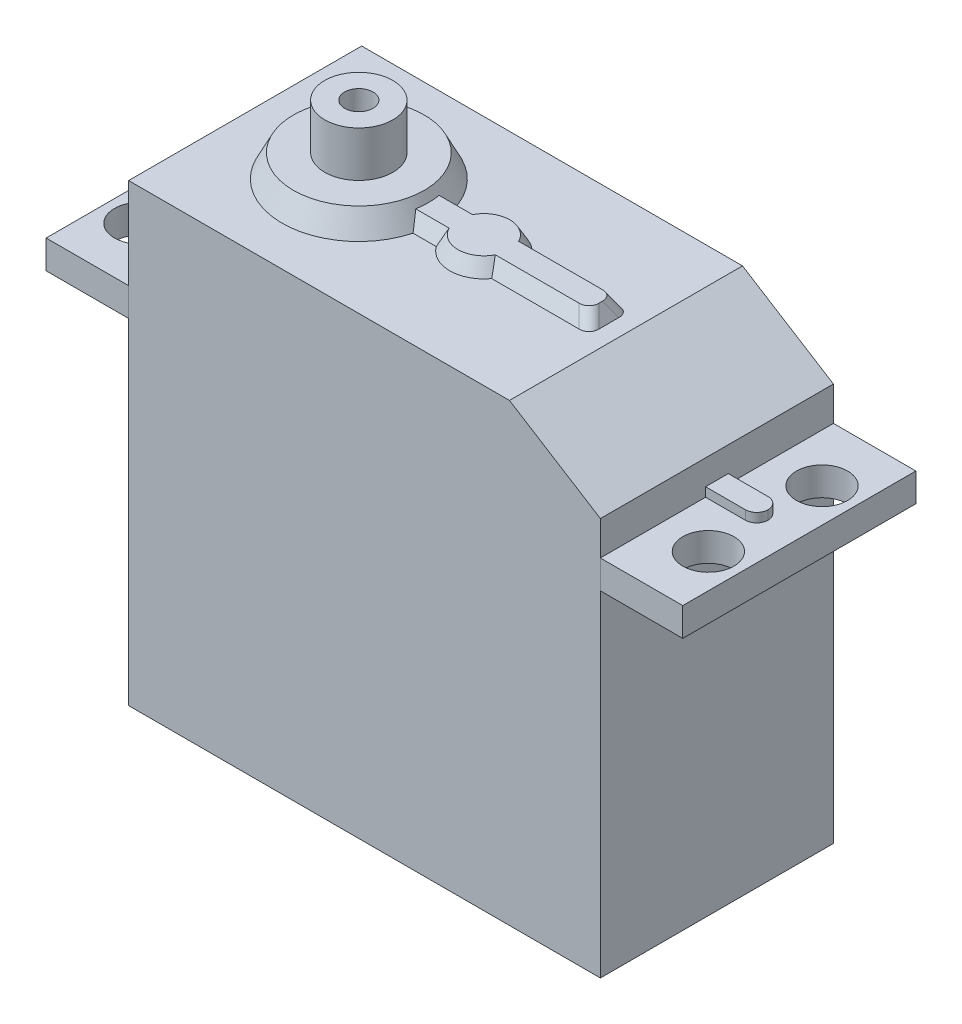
ISO-10303-21;
HEADER;
FILE_DESCRIPTION(('STEP AP214'),'2;1');
FILE_NAME('part.step','',(''),(''),'','','');
FILE_SCHEMA(('AUTOMOTIVE_DESIGN { 1 0 10303 214 1 1 1 1 }'));
ENDSEC;
DATA;
#1=APPLICATION_CONTEXT('core data for automotive mechanical design processes');
#2=APPLICATION_PROTOCOL_DEFINITION('international standard','automotive_design',2000,#1);
#3=PRODUCT_CONTEXT('',#1,'mechanical');
#4=PRODUCT('Part','Part','',(#3));
#5=PRODUCT_RELATED_PRODUCT_CATEGORY('part','',(#4));
#6=PRODUCT_DEFINITION_FORMATION('','',#4);
#7=PRODUCT_DEFINITION_CONTEXT('part definition',#1,'design');
#8=PRODUCT_DEFINITION('design','',#6,#7);
#9=PRODUCT_DEFINITION_SHAPE('','',#8);
#10=(LENGTH_UNIT() NAMED_UNIT(*) SI_UNIT(.MILLI.,.METRE.));
#11=(NAMED_UNIT(*) PLANE_ANGLE_UNIT() SI_UNIT($,.RADIAN.));
#12=(NAMED_UNIT(*) SI_UNIT($,.STERADIAN.) SOLID_ANGLE_UNIT());
#13=UNCERTAINTY_MEASURE_WITH_UNIT(LENGTH_MEASURE(1.E-05),#10,'distance_accuracy_value','');
#14=(GEOMETRIC_REPRESENTATION_CONTEXT(3) GLOBAL_UNCERTAINTY_ASSIGNED_CONTEXT((#13)) GLOBAL_UNIT_ASSIGNED_CONTEXT((#10,
#11,#12)) REPRESENTATION_CONTEXT('',''));
#15=CARTESIAN_POINT('',(0.,0.,0.));
#16=DIRECTION('',(0.,0.,1.));
#17=DIRECTION('',(1.,0.,0.));
#18=AXIS2_PLACEMENT_3D('',#15,#16,#17);
#19=CARTESIAN_POINT('',(-10.,-40.,-10.25));
#20=DIRECTION('',(-1.,0.,0.));
#21=DIRECTION('',(0.,0.,1.));
#22=AXIS2_PLACEMENT_3D('',#19,#20,#21);
#23=PLANE('',#22);
#24=DIRECTION('',(0.,0.,1.));
#25=VECTOR('',#24,1.);
#26=CARTESIAN_POINT('',(-10.,-35.5,-3.5));
#27=LINE('',#26,#25);
#28=CARTESIAN_POINT('',(-10.,-35.5,-3.5));
#29=VERTEX_POINT('',#28);
#30=CARTESIAN_POINT('',(-10.,-35.5,3.5));
#31=VERTEX_POINT('',#30);
#32=EDGE_CURVE('E633',#29,#31,#27,.T.);
#33=ORIENTED_EDGE('',*,*,#32,.F.);
#34=DIRECTION('',(0.,-1.,0.));
#35=VECTOR('',#34,1.);
#36=CARTESIAN_POINT('',(-10.,-31.,-3.5));
#37=LINE('',#36,#35);
#38=CARTESIAN_POINT('',(-10.,-31.,-3.5));
#39=VERTEX_POINT('',#38);
#40=EDGE_CURVE('E378',#39,#29,#37,.T.);
#41=ORIENTED_EDGE('',*,*,#40,.F.);
#42=DIRECTION('',(0.,0.,-1.));
#43=VECTOR('',#42,1.);
#44=CARTESIAN_POINT('',(-10.,-31.,-3.5));
#45=LINE('',#44,#43);
#46=CARTESIAN_POINT('',(-10.,-31.,3.5));
#47=VERTEX_POINT('',#46);
#48=EDGE_CURVE('E374',#47,#39,#45,.T.);
#49=ORIENTED_EDGE('',*,*,#48,.F.);
#50=DIRECTION('',(0.,1.,0.));
#51=VECTOR('',#50,1.);
#52=CARTESIAN_POINT('',(-10.,-31.,3.5));
#53=LINE('',#52,#51);
#54=EDGE_CURVE('E661',#31,#47,#53,.T.);
#55=ORIENTED_EDGE('',*,*,#54,.F.);
#56=EDGE_LOOP('',(#33,#41,#49,#55));
#57=FACE_BOUND('',#56,.T.);
#58=DIRECTION('',(0.,1.,0.));
#59=VECTOR('',#58,1.);
#60=CARTESIAN_POINT('',(-10.,-40.,10.25));
#61=LINE('',#60,#59);
#62=CARTESIAN_POINT('',(-10.,-40.,10.25));
#63=VERTEX_POINT('',#62);
#64=CARTESIAN_POINT('',(-10.,-10.5,10.25));
#65=VERTEX_POINT('',#64);
#66=EDGE_CURVE('E638',#63,#65,#61,.T.);
#67=ORIENTED_EDGE('',*,*,#66,.T.);
#68=DIRECTION('',(0.,0.,-1.));
#69=VECTOR('',#68,1.);
#70=CARTESIAN_POINT('',(-10.,-10.5,-10.25));
#71=LINE('',#70,#69);
#72=CARTESIAN_POINT('',(-10.,-10.5,-10.25));
#73=VERTEX_POINT('',#72);
#74=EDGE_CURVE('E815',#65,#73,#71,.T.);
#75=ORIENTED_EDGE('',*,*,#74,.T.);
#76=DIRECTION('',(0.,1.,0.));
#77=VECTOR('',#76,1.);
#78=CARTESIAN_POINT('',(-10.,-40.,-10.25));
#79=LINE('',#78,#77);
#80=CARTESIAN_POINT('',(-10.,-40.,-10.25));
#81=VERTEX_POINT('',#80);
#82=EDGE_CURVE('E808',#81,#73,#79,.T.);
#83=ORIENTED_EDGE('',*,*,#82,.F.);
#84=DIRECTION('',(0.,0.,1.));
#85=VECTOR('',#84,1.);
#86=CARTESIAN_POINT('',(-10.,-40.,-10.25));
#87=LINE('',#86,#85);
#88=EDGE_CURVE('E789',#81,#63,#87,.T.);
#89=ORIENTED_EDGE('',*,*,#88,.T.);
#90=EDGE_LOOP('',(#67,#75,#83,#89));
#91=FACE_BOUND('',#90,.T.);
#92=CARTESIAN_POINT('',(-10.,-22.,0.));
#93=DIRECTION('',(-1.,0.,0.));
#94=DIRECTION('',(0.,0.,1.));
#95=AXIS2_PLACEMENT_3D('',#92,#93,#94);
#96=CIRCLE('',#95,2.);
#97=CARTESIAN_POINT('',(-10.,-22.,2.));
#98=VERTEX_POINT('',#97);
#99=EDGE_CURVE('E641',#98,#98,#96,.T.);
#100=ORIENTED_EDGE('',*,*,#99,.F.);
#101=EDGE_LOOP('',(#100));
#102=FACE_BOUND('',#101,.T.);
#103=ADVANCED_FACE('F38',(#57,#91,#102),#23,.T.);
#104=CARTESIAN_POINT('',(0.,2.,0.));
#105=DIRECTION('',(0.,1.,0.));
#106=DIRECTION('',(0.,0.,1.));
#107=AXIS2_PLACEMENT_3D('',#104,#105,#106);
#108=PLANE('',#107);
#109=CARTESIAN_POINT('',(0.,2.,0.));
#110=DIRECTION('',(0.,1.,0.));
#111=DIRECTION('',(0.,0.,1.));
#112=AXIS2_PLACEMENT_3D('',#109,#110,#111);
#113=CIRCLE('',#112,5.74999999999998);
#114=CARTESIAN_POINT('',(0.,2.,5.74999999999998));
#115=VERTEX_POINT('',#114);
#116=EDGE_CURVE('E723',#115,#115,#113,.T.);
#117=ORIENTED_EDGE('',*,*,#116,.T.);
#118=EDGE_LOOP('',(#117));
#119=FACE_BOUND('',#118,.T.);
#120=CARTESIAN_POINT('',(0.,2.,0.));
#121=DIRECTION('',(0.,1.,0.));
#122=DIRECTION('',(0.,0.,1.));
#123=AXIS2_PLACEMENT_3D('',#120,#121,#122);
#124=CIRCLE('',#123,3.);
#125=CARTESIAN_POINT('',(0.,2.,3.));
#126=VERTEX_POINT('',#125);
#127=EDGE_CURVE('E42',#126,#126,#124,.F.);
#128=ORIENTED_EDGE('',*,*,#127,.T.);
#129=EDGE_LOOP('',(#128));
#130=FACE_BOUND('',#129,.T.);
#131=ADVANCED_FACE('F480',(#119,#130),#108,.T.);
#132=CARTESIAN_POINT('',(0.,0.,0.));
#133=DIRECTION('',(0.,1.,0.));
#134=DIRECTION('',(0.,0.,1.));
#135=AXIS2_PLACEMENT_3D('',#132,#133,#134);
#136=PLANE('',#135);
#137=DIRECTION('',(1.,0.,0.));
#138=VECTOR('',#137,1.);
#139=CARTESIAN_POINT('',(-10.,0.,10.25));
#140=LINE('',#139,#138);
#141=CARTESIAN_POINT('',(-10.,0.,10.25));
#142=VERTEX_POINT('',#141);
#143=CARTESIAN_POINT('',(23.4999999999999,0.,10.25));
#144=VERTEX_POINT('',#143);
#145=EDGE_CURVE('E704',#142,#144,#140,.T.);
#146=ORIENTED_EDGE('',*,*,#145,.T.);
#147=DIRECTION('',(0.,0.,-1.));
#148=VECTOR('',#147,1.);
#149=CARTESIAN_POINT('',(23.5,0.,0.));
#150=LINE('',#149,#148);
#151=CARTESIAN_POINT('',(23.4999999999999,0.,-10.25));
#152=VERTEX_POINT('',#151);
#153=EDGE_CURVE('E812',#144,#152,#150,.T.);
#154=ORIENTED_EDGE('',*,*,#153,.T.);
#155=DIRECTION('',(-1.,0.,0.));
#156=VECTOR('',#155,1.);
#157=CARTESIAN_POINT('',(-10.,0.,-10.25));
#158=LINE('',#157,#156);
#159=CARTESIAN_POINT('',(-10.,0.,-10.25));
#160=VERTEX_POINT('',#159);
#161=EDGE_CURVE('E707',#152,#160,#158,.T.);
#162=ORIENTED_EDGE('',*,*,#161,.T.);
#163=DIRECTION('',(0.,0.,1.));
#164=VECTOR('',#163,1.);
#165=CARTESIAN_POINT('',(-10.,0.,-10.25));
#166=LINE('',#165,#164);
#167=EDGE_CURVE('E708',#160,#142,#166,.T.);
#168=ORIENTED_EDGE('',*,*,#167,.T.);
#169=EDGE_LOOP('',(#146,#154,#162,#168));
#170=FACE_BOUND('',#169,.T.);
#171=CARTESIAN_POINT('',(11.,0.,0.));
#172=DIRECTION('',(0.,1.,0.));
#173=DIRECTION('',(0.,0.,1.));
#174=AXIS2_PLACEMENT_3D('',#171,#172,#173);
#175=CIRCLE('',#174,3.);
#176=CARTESIAN_POINT('',(8.56330141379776,0.,1.75));
#177=VERTEX_POINT('',#176);
#178=CARTESIAN_POINT('',(13.4366985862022,0.,1.75));
#179=VERTEX_POINT('',#178);
#180=EDGE_CURVE('E397',#177,#179,#175,.T.);
#181=ORIENTED_EDGE('',*,*,#180,.F.);
#182=DIRECTION('',(1.,0.,0.));
#183=VECTOR('',#182,1.);
#184=CARTESIAN_POINT('',(2.98288094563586,0.,1.75));
#185=LINE('',#184,#183);
#186=CARTESIAN_POINT('',(6.51920240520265,0.,1.75000000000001));
#187=VERTEX_POINT('',#186);
#188=EDGE_CURVE('E394',#187,#177,#185,.T.);
#189=ORIENTED_EDGE('',*,*,#188,.F.);
#190=CARTESIAN_POINT('',(0.,0.,0.));
#191=DIRECTION('',(0.,1.,0.));
#192=DIRECTION('',(0.,0.,1.));
#193=AXIS2_PLACEMENT_3D('',#190,#191,#192);
#194=CIRCLE('',#193,6.75);
#195=CARTESIAN_POINT('',(6.51920240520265,0.,-1.75000000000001));
#196=VERTEX_POINT('',#195);
#197=EDGE_CURVE('E465',#196,#187,#194,.T.);
#198=ORIENTED_EDGE('',*,*,#197,.F.);
#199=DIRECTION('',(1.,0.,0.));
#200=VECTOR('',#199,1.);
#201=CARTESIAN_POINT('',(2.98288094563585,0.,-1.75));
#202=LINE('',#201,#200);
#203=CARTESIAN_POINT('',(8.56330141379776,0.,-1.75));
#204=VERTEX_POINT('',#203);
#205=EDGE_CURVE('E412',#196,#204,#202,.T.);
#206=ORIENTED_EDGE('',*,*,#205,.T.);
#207=CARTESIAN_POINT('',(11.,0.,0.));
#208=DIRECTION('',(0.,1.,0.));
#209=DIRECTION('',(0.,0.,1.));
#210=AXIS2_PLACEMENT_3D('',#207,#208,#209);
#211=CIRCLE('',#210,3.);
#212=CARTESIAN_POINT('',(13.4366985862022,0.,-1.75));
#213=VERTEX_POINT('',#212);
#214=EDGE_CURVE('E409',#213,#204,#211,.T.);
#215=ORIENTED_EDGE('',*,*,#214,.F.);
#216=DIRECTION('',(1.,0.,0.));
#217=VECTOR('',#216,1.);
#218=CARTESIAN_POINT('',(13.4366985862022,0.,-1.75));
#219=LINE('',#218,#217);
#220=CARTESIAN_POINT('',(21.1339745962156,0.,-1.75));
#221=VERTEX_POINT('',#220);
#222=EDGE_CURVE('E406',#213,#221,#219,.T.);
#223=ORIENTED_EDGE('',*,*,#222,.T.);
#224=CARTESIAN_POINT('',(20.8452994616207,0.,-0.595299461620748));
#225=DIRECTION('',(0.,1.,0.));
#226=DIRECTION('',(0.707106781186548,0.,-0.707106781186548));
#227=AXIS2_PLACEMENT_3D('',#224,#225,#226);
#228=ELLIPSE('',#227,1.29099444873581,1.);
#229=CARTESIAN_POINT('',(22.,0.,-0.883974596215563));
#230=VERTEX_POINT('',#229);
#231=EDGE_CURVE('E48',#221,#230,#228,.F.);
#232=ORIENTED_EDGE('',*,*,#231,.T.);
#233=DIRECTION('',(0.,0.,1.));
#234=VECTOR('',#233,1.);
#235=CARTESIAN_POINT('',(22.,0.,-1.75));
#236=LINE('',#235,#234);
#237=CARTESIAN_POINT('',(22.,0.,0.883974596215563));
#238=VERTEX_POINT('',#237);
#239=EDGE_CURVE('E403',#230,#238,#236,.T.);
#240=ORIENTED_EDGE('',*,*,#239,.T.);
#241=CARTESIAN_POINT('',(20.8452994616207,0.,0.595299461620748));
#242=DIRECTION('',(0.,1.,0.));
#243=DIRECTION('',(0.707106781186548,0.,0.707106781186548));
#244=AXIS2_PLACEMENT_3D('',#241,#242,#243);
#245=ELLIPSE('',#244,1.29099444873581,1.);
#246=CARTESIAN_POINT('',(21.1339745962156,0.,1.75));
#247=VERTEX_POINT('',#246);
#248=EDGE_CURVE('E1014',#238,#247,#245,.F.);
#249=ORIENTED_EDGE('',*,*,#248,.T.);
#250=DIRECTION('',(1.,0.,0.));
#251=VECTOR('',#250,1.);
#252=CARTESIAN_POINT('',(13.4366985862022,0.,1.75));
#253=LINE('',#252,#251);
#254=EDGE_CURVE('E400',#179,#247,#253,.T.);
#255=ORIENTED_EDGE('',*,*,#254,.F.);
#256=EDGE_LOOP('',(#181,#189,#198,#206,#215,#223,#232,#240,#249,#255));
#257=FACE_BOUND('',#256,.T.);
#258=ADVANCED_FACE('F575',(#170,#257),#136,.T.);
#259=CARTESIAN_POINT('',(0.,2.,0.));
#260=DIRECTION('',(0.,-1.,0.));
#261=DIRECTION('',(0.,0.,-1.));
#262=AXIS2_PLACEMENT_3D('',#259,#260,#261);
#263=CONICAL_SURFACE('',#262,5.74999999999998,0.463647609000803);
#264=ORIENTED_EDGE('',*,*,#116,.F.);
#265=EDGE_LOOP('',(#264));
#266=FACE_BOUND('',#265,.T.);
#267=ORIENTED_EDGE('',*,*,#197,.T.);
#268=CARTESIAN_POINT('',(0.,-28.3756443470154,18.1326859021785));
#269=DIRECTION('',(0.,0.500000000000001,0.866025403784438));
#270=DIRECTION('',(0.,-0.866025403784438,0.500000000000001));
#271=AXIS2_PLACEMENT_3D('',#268,#269,#270);
#272=ELLIPSE('',#271,41.8756443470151,10.4689110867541);
#273=CARTESIAN_POINT('',(6.03806252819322,1.25,1.02831216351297));
#274=VERTEX_POINT('',#273);
#275=EDGE_CURVE('E999',#187,#274,#272,.T.);
#276=ORIENTED_EDGE('',*,*,#275,.T.);
#277=CARTESIAN_POINT('',(0.,1.25,0.));
#278=DIRECTION('',(0.,1.,0.));
#279=DIRECTION('',(0.,0.,1.));
#280=AXIS2_PLACEMENT_3D('',#277,#278,#279);
#281=CIRCLE('',#280,6.12499999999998);
#282=CARTESIAN_POINT('',(6.03806252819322,1.25,-1.02831216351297));
#283=VERTEX_POINT('',#282);
#284=EDGE_CURVE('E726',#283,#274,#281,.F.);
#285=ORIENTED_EDGE('',*,*,#284,.F.);
#286=CARTESIAN_POINT('',(0.,-28.3756443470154,-18.1326859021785));
#287=DIRECTION('',(0.,0.500000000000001,-0.866025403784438));
#288=DIRECTION('',(0.,-0.866025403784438,-0.500000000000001));
#289=AXIS2_PLACEMENT_3D('',#286,#287,#288);
#290=ELLIPSE('',#289,41.8756443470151,10.4689110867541);
#291=EDGE_CURVE('E996',#196,#283,#290,.F.);
#292=ORIENTED_EDGE('',*,*,#291,.F.);
#293=EDGE_LOOP('',(#267,#276,#285,#292));
#294=FACE_BOUND('',#293,.T.);
#295=ADVANCED_FACE('F578',(#266,#294),#263,.T.);
#296=DIRECTION('',(0.,0.,-1.));
#297=VECTOR('',#296,1.);
#298=CARTESIAN_POINT('',(-10.,-7.2,-10.25));
#299=LINE('',#298,#297);
#300=CARTESIAN_POINT('',(-10.,-7.2,1.));
#301=VERTEX_POINT('',#300);
#302=CARTESIAN_POINT('',(-10.,-7.2,-1.));
#303=VERTEX_POINT('',#302);
#304=EDGE_CURVE('E946',#301,#303,#299,.T.);
#305=ORIENTED_EDGE('',*,*,#304,.F.);
#306=DIRECTION('',(0.,-1.,0.));
#307=VECTOR('',#306,1.);
#308=CARTESIAN_POINT('',(-10.,-40.,0.999999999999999));
#309=LINE('',#308,#307);
#310=CARTESIAN_POINT('',(-10.,-8.,1.));
#311=VERTEX_POINT('',#310);
#312=EDGE_CURVE('E913',#301,#311,#309,.T.);
#313=ORIENTED_EDGE('',*,*,#312,.T.);
#314=DIRECTION('',(0.,0.,-1.));
#315=VECTOR('',#314,1.);
#316=CARTESIAN_POINT('',(-10.,-8.,-10.25));
#317=LINE('',#316,#315);
#318=CARTESIAN_POINT('',(-10.,-8.,10.25));
#319=VERTEX_POINT('',#318);
#320=EDGE_CURVE('E880',#319,#311,#317,.T.);
#321=ORIENTED_EDGE('',*,*,#320,.F.);
#322=EDGE_CURVE('E673',#319,#142,#61,.T.);
#323=ORIENTED_EDGE('',*,*,#322,.T.);
#324=ORIENTED_EDGE('',*,*,#167,.F.);
#325=CARTESIAN_POINT('',(-10.,-8.,-10.25));
#326=VERTEX_POINT('',#325);
#327=EDGE_CURVE('E805',#326,#160,#79,.T.);
#328=ORIENTED_EDGE('',*,*,#327,.F.);
#329=CARTESIAN_POINT('',(-10.,-8.,-1.));
#330=VERTEX_POINT('',#329);
#331=EDGE_CURVE('E881',#330,#326,#317,.T.);
#332=ORIENTED_EDGE('',*,*,#331,.F.);
#333=DIRECTION('',(0.,1.,0.));
#334=VECTOR('',#333,1.);
#335=CARTESIAN_POINT('',(-10.,-40.,-0.999999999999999));
#336=LINE('',#335,#334);
#337=EDGE_CURVE('E740',#330,#303,#336,.T.);
#338=ORIENTED_EDGE('',*,*,#337,.T.);
#339=EDGE_LOOP('',(#305,#313,#321,#323,#324,#328,#332,#338));
#340=FACE_BOUND('',#339,.T.);
#341=ADVANCED_FACE('F586',(#340),#23,.T.);
#342=CARTESIAN_POINT('',(31.5,-40.,-10.25));
#343=DIRECTION('',(1.,0.,0.));
#344=DIRECTION('',(0.,0.,-1.));
#345=AXIS2_PLACEMENT_3D('',#342,#343,#344);
#346=PLANE('',#345);
#347=DIRECTION('',(0.,0.,1.));
#348=VECTOR('',#347,1.);
#349=CARTESIAN_POINT('',(31.5,-8.,-10.25));
#350=LINE('',#349,#348);
#351=CARTESIAN_POINT('',(31.5,-8.,1.));
#352=VERTEX_POINT('',#351);
#353=CARTESIAN_POINT('',(31.5,-8.,10.25));
#354=VERTEX_POINT('',#353);
#355=EDGE_CURVE('E867',#352,#354,#350,.T.);
#356=ORIENTED_EDGE('',*,*,#355,.F.);
#357=DIRECTION('',(0.,1.,0.));
#358=VECTOR('',#357,1.);
#359=CARTESIAN_POINT('',(31.5,-40.,0.999999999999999));
#360=LINE('',#359,#358);
#361=CARTESIAN_POINT('',(31.5,-7.2,1.));
#362=VERTEX_POINT('',#361);
#363=EDGE_CURVE('E759',#352,#362,#360,.T.);
#364=ORIENTED_EDGE('',*,*,#363,.T.);
#365=DIRECTION('',(0.,0.,1.));
#366=VECTOR('',#365,1.);
#367=CARTESIAN_POINT('',(31.5,-7.2,-10.25));
#368=LINE('',#367,#366);
#369=CARTESIAN_POINT('',(31.5,-7.2,-1.));
#370=VERTEX_POINT('',#369);
#371=EDGE_CURVE('E932',#370,#362,#368,.T.);
#372=ORIENTED_EDGE('',*,*,#371,.F.);
#373=DIRECTION('',(0.,-1.,0.));
#374=VECTOR('',#373,1.);
#375=CARTESIAN_POINT('',(31.5,-40.,-0.999999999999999));
#376=LINE('',#375,#374);
#377=CARTESIAN_POINT('',(31.5,-8.,-1.));
#378=VERTEX_POINT('',#377);
#379=EDGE_CURVE('E748',#370,#378,#376,.T.);
#380=ORIENTED_EDGE('',*,*,#379,.T.);
#381=CARTESIAN_POINT('',(31.5,-8.,-10.25));
#382=VERTEX_POINT('',#381);
#383=EDGE_CURVE('E873',#382,#378,#350,.T.);
#384=ORIENTED_EDGE('',*,*,#383,.F.);
#385=DIRECTION('',(0.,1.,0.));
#386=VECTOR('',#385,1.);
#387=CARTESIAN_POINT('',(31.5,-40.,-10.25));
#388=LINE('',#387,#386);
#389=CARTESIAN_POINT('',(31.5,-5.00000000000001,-10.25));
#390=VERTEX_POINT('',#389);
#391=EDGE_CURVE('E713',#382,#390,#388,.T.);
#392=ORIENTED_EDGE('',*,*,#391,.T.);
#393=DIRECTION('',(0.,0.,1.));
#394=VECTOR('',#393,1.);
#395=CARTESIAN_POINT('',(31.5,-5.00000000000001,-10.25));
#396=LINE('',#395,#394);
#397=CARTESIAN_POINT('',(31.5,-5.00000000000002,10.25));
#398=VERTEX_POINT('',#397);
#399=EDGE_CURVE('E816',#390,#398,#396,.T.);
#400=ORIENTED_EDGE('',*,*,#399,.T.);
#401=DIRECTION('',(0.,1.,0.));
#402=VECTOR('',#401,1.);
#403=CARTESIAN_POINT('',(31.5,-40.,10.25));
#404=LINE('',#403,#402);
#405=EDGE_CURVE('E670',#354,#398,#404,.T.);
#406=ORIENTED_EDGE('',*,*,#405,.F.);
#407=EDGE_LOOP('',(#356,#364,#372,#380,#384,#392,#400,#406));
#408=FACE_BOUND('',#407,.T.);
#409=ADVANCED_FACE('F552',(#408),#346,.T.);
#410=CARTESIAN_POINT('',(0.,-8.,0.));
#411=DIRECTION('',(0.,-1.,0.));
#412=DIRECTION('',(0.,0.,-1.));
#413=AXIS2_PLACEMENT_3D('',#410,#411,#412);
#414=PLANE('',#413);
#415=CARTESIAN_POINT('',(-14.25,-8.,-4.99694744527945));
#416=DIRECTION('',(0.,1.,0.));
#417=DIRECTION('',(0.,0.,1.));
#418=AXIS2_PLACEMENT_3D('',#415,#416,#417);
#419=CIRCLE('',#418,2.25);
#420=CARTESIAN_POINT('',(-14.25,-8.,-2.74694744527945));
#421=VERTEX_POINT('',#420);
#422=EDGE_CURVE('E938',#421,#421,#419,.T.);
#423=ORIENTED_EDGE('',*,*,#422,.F.);
#424=EDGE_LOOP('',(#423));
#425=FACE_BOUND('',#424,.T.);
#426=CARTESIAN_POINT('',(-14.25,-8.,5.00305255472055));
#427=DIRECTION('',(0.,1.,0.));
#428=DIRECTION('',(0.,0.,-1.));
#429=AXIS2_PLACEMENT_3D('',#426,#427,#428);
#430=CIRCLE('',#429,2.25);
#431=CARTESIAN_POINT('',(-14.25,-8.,2.75305255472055));
#432=VERTEX_POINT('',#431);
#433=EDGE_CURVE('E939',#432,#432,#430,.T.);
#434=ORIENTED_EDGE('',*,*,#433,.F.);
#435=EDGE_LOOP('',(#434));
#436=FACE_BOUND('',#435,.T.);
#437=DIRECTION('',(1.,0.,0.));
#438=VECTOR('',#437,1.);
#439=CARTESIAN_POINT('',(-14.5,-8.,1.));
#440=LINE('',#439,#438);
#441=CARTESIAN_POINT('',(-13.5,-8.,1.));
#442=VERTEX_POINT('',#441);
#443=EDGE_CURVE('E754',#442,#311,#440,.T.);
#444=ORIENTED_EDGE('',*,*,#443,.F.);
#445=CARTESIAN_POINT('',(-13.5,-8.,0.));
#446=DIRECTION('',(0.,-1.,0.));
#447=DIRECTION('',(0.,0.,-1.));
#448=AXIS2_PLACEMENT_3D('',#445,#446,#447);
#449=CIRCLE('',#448,1.);
#450=CARTESIAN_POINT('',(-14.5,-8.,0.));
#451=VERTEX_POINT('',#450);
#452=EDGE_CURVE('E727',#442,#451,#449,.T.);
#453=ORIENTED_EDGE('',*,*,#452,.T.);
#454=CARTESIAN_POINT('',(-13.5,-8.,0.));
#455=DIRECTION('',(0.,-1.,0.));
#456=DIRECTION('',(0.,0.,-1.));
#457=AXIS2_PLACEMENT_3D('',#454,#455,#456);
#458=CIRCLE('',#457,1.);
#459=CARTESIAN_POINT('',(-13.5,-8.,-1.));
#460=VERTEX_POINT('',#459);
#461=EDGE_CURVE('E965',#451,#460,#458,.T.);
#462=ORIENTED_EDGE('',*,*,#461,.T.);
#463=DIRECTION('',(-1.,0.,0.));
#464=VECTOR('',#463,1.);
#465=CARTESIAN_POINT('',(-14.5,-8.,-1.));
#466=LINE('',#465,#464);
#467=EDGE_CURVE('E773',#330,#460,#466,.T.);
#468=ORIENTED_EDGE('',*,*,#467,.F.);
#469=ORIENTED_EDGE('',*,*,#331,.T.);
#470=DIRECTION('',(-1.,0.,0.));
#471=VECTOR('',#470,1.);
#472=CARTESIAN_POINT('',(-10.,-8.,-10.25));
#473=LINE('',#472,#471);
#474=CARTESIAN_POINT('',(-17.25,-8.,-10.25));
#475=VERTEX_POINT('',#474);
#476=EDGE_CURVE('E695',#326,#475,#473,.T.);
#477=ORIENTED_EDGE('',*,*,#476,.T.);
#478=DIRECTION('',(0.,0.,1.));
#479=VECTOR('',#478,1.);
#480=CARTESIAN_POINT('',(-17.25,-8.,-10.25));
#481=LINE('',#480,#479);
#482=CARTESIAN_POINT('',(-17.25,-8.,10.2561051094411));
#483=VERTEX_POINT('',#482);
#484=EDGE_CURVE('E702',#475,#483,#481,.T.);
#485=ORIENTED_EDGE('',*,*,#484,.T.);
#486=DIRECTION('',(1.,0.,0.));
#487=VECTOR('',#486,1.);
#488=CARTESIAN_POINT('',(-10.,-8.,10.2561051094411));
#489=LINE('',#488,#487);
#490=CARTESIAN_POINT('',(-10.,-8.,10.2561051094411));
#491=VERTEX_POINT('',#490);
#492=EDGE_CURVE('E679',#483,#491,#489,.T.);
#493=ORIENTED_EDGE('',*,*,#492,.T.);
#494=EDGE_CURVE('E692',#491,#319,#317,.T.);
#495=ORIENTED_EDGE('',*,*,#494,.T.);
#496=ORIENTED_EDGE('',*,*,#320,.T.);
#497=EDGE_LOOP('',(#444,#453,#462,#468,#469,#477,#485,#493,#495,#496));
#498=FACE_BOUND('',#497,.T.);
#499=ADVANCED_FACE('F524',(#425,#436,#498),#414,.F.);
#500=CARTESIAN_POINT('',(0.,-8.,0.));
#501=DIRECTION('',(0.,1.,0.));
#502=DIRECTION('',(0.,0.,1.));
#503=AXIS2_PLACEMENT_3D('',#500,#501,#502);
#504=PLANE('',#503);
#505=CARTESIAN_POINT('',(35.75,-8.,-4.99694744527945));
#506=DIRECTION('',(0.,1.,0.));
#507=DIRECTION('',(0.,0.,-1.));
#508=AXIS2_PLACEMENT_3D('',#505,#506,#507);
#509=CIRCLE('',#508,2.25000000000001);
#510=CARTESIAN_POINT('',(35.75,-8.,-7.24694744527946));
#511=VERTEX_POINT('',#510);
#512=EDGE_CURVE('E857',#511,#511,#509,.T.);
#513=ORIENTED_EDGE('',*,*,#512,.F.);
#514=EDGE_LOOP('',(#513));
#515=FACE_BOUND('',#514,.T.);
#516=CARTESIAN_POINT('',(35.75,-8.,5.00305255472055));
#517=DIRECTION('',(0.,1.,0.));
#518=DIRECTION('',(0.,0.,1.));
#519=AXIS2_PLACEMENT_3D('',#516,#517,#518);
#520=CIRCLE('',#519,2.25000000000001);
#521=CARTESIAN_POINT('',(35.75,-8.,7.25305255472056));
#522=VERTEX_POINT('',#521);
#523=EDGE_CURVE('E948',#522,#522,#520,.T.);
#524=ORIENTED_EDGE('',*,*,#523,.F.);
#525=EDGE_LOOP('',(#524));
#526=FACE_BOUND('',#525,.T.);
#527=CARTESIAN_POINT('',(35.,-8.,-1.));
#528=VERTEX_POINT('',#527);
#529=EDGE_CURVE('E772',#528,#378,#466,.T.);
#530=ORIENTED_EDGE('',*,*,#529,.F.);
#531=CARTESIAN_POINT('',(35.,-8.,0.));
#532=DIRECTION('',(0.,1.,0.));
#533=DIRECTION('',(0.,0.,1.));
#534=AXIS2_PLACEMENT_3D('',#531,#532,#533);
#535=CIRCLE('',#534,1.);
#536=CARTESIAN_POINT('',(36.,-8.,0.));
#537=VERTEX_POINT('',#536);
#538=EDGE_CURVE('E967',#528,#537,#535,.F.);
#539=ORIENTED_EDGE('',*,*,#538,.T.);
#540=CARTESIAN_POINT('',(35.,-8.,0.));
#541=DIRECTION('',(0.,1.,0.));
#542=DIRECTION('',(0.,0.,1.));
#543=AXIS2_PLACEMENT_3D('',#540,#541,#542);
#544=CIRCLE('',#543,1.);
#545=CARTESIAN_POINT('',(35.,-8.,1.));
#546=VERTEX_POINT('',#545);
#547=EDGE_CURVE('E962',#537,#546,#544,.F.);
#548=ORIENTED_EDGE('',*,*,#547,.T.);
#549=DIRECTION('',(-1.,0.,0.));
#550=VECTOR('',#549,1.);
#551=CARTESIAN_POINT('',(0.,-8.,1.));
#552=LINE('',#551,#550);
#553=EDGE_CURVE('E733',#546,#352,#552,.T.);
#554=ORIENTED_EDGE('',*,*,#553,.T.);
#555=ORIENTED_EDGE('',*,*,#355,.T.);
#556=CARTESIAN_POINT('',(31.5,-8.,10.2561051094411));
#557=VERTEX_POINT('',#556);
#558=EDGE_CURVE('E864',#354,#557,#350,.T.);
#559=ORIENTED_EDGE('',*,*,#558,.T.);
#560=DIRECTION('',(1.,0.,0.));
#561=VECTOR('',#560,1.);
#562=CARTESIAN_POINT('',(31.5,-8.,10.2561051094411));
#563=LINE('',#562,#561);
#564=CARTESIAN_POINT('',(38.75,-8.,10.2561051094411));
#565=VERTEX_POINT('',#564);
#566=EDGE_CURVE('E869',#557,#565,#563,.T.);
#567=ORIENTED_EDGE('',*,*,#566,.T.);
#568=DIRECTION('',(0.,0.,-1.));
#569=VECTOR('',#568,1.);
#570=CARTESIAN_POINT('',(38.75,-8.,-10.25));
#571=LINE('',#570,#569);
#572=CARTESIAN_POINT('',(38.75,-8.,-10.25));
#573=VERTEX_POINT('',#572);
#574=EDGE_CURVE('E1089',#565,#573,#571,.T.);
#575=ORIENTED_EDGE('',*,*,#574,.T.);
#576=DIRECTION('',(-1.,0.,0.));
#577=VECTOR('',#576,1.);
#578=CARTESIAN_POINT('',(31.5,-8.,-10.25));
#579=LINE('',#578,#577);
#580=EDGE_CURVE('E856',#573,#382,#579,.T.);
#581=ORIENTED_EDGE('',*,*,#580,.T.);
#582=ORIENTED_EDGE('',*,*,#383,.T.);
#583=EDGE_LOOP('',(#530,#539,#548,#554,#555,#559,#567,#575,#581,#582));
#584=FACE_BOUND('',#583,.T.);
#585=ADVANCED_FACE('F520',(#515,#526,#584),#504,.T.);
#586=CARTESIAN_POINT('',(31.5,-40.,-10.25));
#587=VERTEX_POINT('',#586);
#588=CARTESIAN_POINT('',(31.5,-10.5,-10.25));
#589=VERTEX_POINT('',#588);
#590=EDGE_CURVE('E833',#587,#589,#388,.T.);
#591=ORIENTED_EDGE('',*,*,#590,.T.);
#592=DIRECTION('',(0.,0.,1.));
#593=VECTOR('',#592,1.);
#594=CARTESIAN_POINT('',(31.5,-10.5,-10.25));
#595=LINE('',#594,#593);
#596=CARTESIAN_POINT('',(31.5,-10.5,10.25));
#597=VERTEX_POINT('',#596);
#598=EDGE_CURVE('E846',#589,#597,#595,.T.);
#599=ORIENTED_EDGE('',*,*,#598,.T.);
#600=CARTESIAN_POINT('',(31.5,-40.,10.25));
#601=VERTEX_POINT('',#600);
#602=EDGE_CURVE('E710',#601,#597,#404,.T.);
#603=ORIENTED_EDGE('',*,*,#602,.F.);
#604=DIRECTION('',(0.,0.,-1.));
#605=VECTOR('',#604,1.);
#606=CARTESIAN_POINT('',(31.5,-40.,-10.25));
#607=LINE('',#606,#605);
#608=EDGE_CURVE('E921',#601,#587,#607,.T.);
#609=ORIENTED_EDGE('',*,*,#608,.T.);
#610=EDGE_LOOP('',(#591,#599,#603,#609));
#611=FACE_BOUND('',#610,.T.);
#612=ADVANCED_FACE('F523',(#611),#346,.T.);
#613=CARTESIAN_POINT('',(-10.,-40.,-10.25));
#614=DIRECTION('',(0.,0.,-1.));
#615=DIRECTION('',(-1.,0.,0.));
#616=AXIS2_PLACEMENT_3D('',#613,#614,#615);
#617=PLANE('',#616);
#618=ORIENTED_EDGE('',*,*,#161,.F.);
#619=DIRECTION('',(-0.847998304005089,0.529998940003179,0.));
#620=VECTOR('',#619,1.);
#621=CARTESIAN_POINT('',(17.3876404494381,3.82022471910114,-10.25));
#622=LINE('',#621,#620);
#623=EDGE_CURVE('E819',#152,#390,#622,.F.);
#624=ORIENTED_EDGE('',*,*,#623,.T.);
#625=ORIENTED_EDGE('',*,*,#391,.F.);
#626=ORIENTED_EDGE('',*,*,#580,.F.);
#627=DIRECTION('',(0.,1.,0.));
#628=VECTOR('',#627,1.);
#629=CARTESIAN_POINT('',(38.75,-10.5,-10.25));
#630=LINE('',#629,#628);
#631=CARTESIAN_POINT('',(38.75,-10.5,-10.25));
#632=VERTEX_POINT('',#631);
#633=EDGE_CURVE('E958',#632,#573,#630,.T.);
#634=ORIENTED_EDGE('',*,*,#633,.F.);
#635=DIRECTION('',(-1.,0.,0.));
#636=VECTOR('',#635,1.);
#637=CARTESIAN_POINT('',(31.5,-10.5,-10.25));
#638=LINE('',#637,#636);
#639=EDGE_CURVE('E851',#632,#589,#638,.T.);
#640=ORIENTED_EDGE('',*,*,#639,.T.);
#641=ORIENTED_EDGE('',*,*,#590,.F.);
#642=DIRECTION('',(-1.,0.,0.));
#643=VECTOR('',#642,1.);
#644=CARTESIAN_POINT('',(-10.,-40.,-10.25));
#645=LINE('',#644,#643);
#646=EDGE_CURVE('E699',#587,#81,#645,.T.);
#647=ORIENTED_EDGE('',*,*,#646,.T.);
#648=ORIENTED_EDGE('',*,*,#82,.T.);
#649=DIRECTION('',(-1.,0.,0.));
#650=VECTOR('',#649,1.);
#651=CARTESIAN_POINT('',(-10.,-10.5,-10.25));
#652=LINE('',#651,#650);
#653=CARTESIAN_POINT('',(-17.25,-10.5,-10.25));
#654=VERTEX_POINT('',#653);
#655=EDGE_CURVE('E678',#73,#654,#652,.T.);
#656=ORIENTED_EDGE('',*,*,#655,.T.);
#657=DIRECTION('',(0.,1.,0.));
#658=VECTOR('',#657,1.);
#659=CARTESIAN_POINT('',(-17.25,-10.5,-10.25));
#660=LINE('',#659,#658);
#661=EDGE_CURVE('E684',#654,#475,#660,.T.);
#662=ORIENTED_EDGE('',*,*,#661,.T.);
#663=ORIENTED_EDGE('',*,*,#476,.F.);
#664=ORIENTED_EDGE('',*,*,#327,.T.);
#665=EDGE_LOOP('',(#618,#624,#625,#626,#634,#640,#641,#647,#648,#656,#662,#663,#664));
#666=FACE_BOUND('',#665,.T.);
#667=ADVANCED_FACE('F580',(#666),#617,.T.);
#668=CARTESIAN_POINT('',(-10.,-40.,10.25));
#669=DIRECTION('',(0.,0.,1.));
#670=DIRECTION('',(1.,0.,0.));
#671=AXIS2_PLACEMENT_3D('',#668,#669,#670);
#672=PLANE('',#671);
#673=ORIENTED_EDGE('',*,*,#602,.T.);
#674=EDGE_CURVE('E714',#597,#354,#404,.T.);
#675=ORIENTED_EDGE('',*,*,#674,.T.);
#676=ORIENTED_EDGE('',*,*,#405,.T.);
#677=DIRECTION('',(0.847998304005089,-0.529998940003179,0.));
#678=VECTOR('',#677,1.);
#679=CARTESIAN_POINT('',(17.3876404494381,3.82022471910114,10.25));
#680=LINE('',#679,#678);
#681=EDGE_CURVE('E813',#398,#144,#680,.F.);
#682=ORIENTED_EDGE('',*,*,#681,.T.);
#683=ORIENTED_EDGE('',*,*,#145,.F.);
#684=ORIENTED_EDGE('',*,*,#322,.F.);
#685=EDGE_CURVE('E671',#65,#319,#61,.T.);
#686=ORIENTED_EDGE('',*,*,#685,.F.);
#687=ORIENTED_EDGE('',*,*,#66,.F.);
#688=DIRECTION('',(1.,0.,0.));
#689=VECTOR('',#688,1.);
#690=CARTESIAN_POINT('',(-10.,-40.,10.25));
#691=LINE('',#690,#689);
#692=EDGE_CURVE('E796',#63,#601,#691,.T.);
#693=ORIENTED_EDGE('',*,*,#692,.T.);
#694=EDGE_LOOP('',(#673,#675,#676,#682,#683,#684,#686,#687,#693));
#695=FACE_BOUND('',#694,.T.);
#696=ADVANCED_FACE('F573',(#695),#672,.T.);
#697=CARTESIAN_POINT('',(0.,-40.,0.));
#698=DIRECTION('',(0.,1.,0.));
#699=DIRECTION('',(0.,0.,1.));
#700=AXIS2_PLACEMENT_3D('',#697,#698,#699);
#701=PLANE('',#700);
#702=CARTESIAN_POINT('',(0.,-40.,0.));
#703=DIRECTION('',(0.,1.,0.));
#704=DIRECTION('',(0.,0.,1.));
#705=AXIS2_PLACEMENT_3D('',#702,#703,#704);
#706=CIRCLE('',#705,1.25);
#707=CARTESIAN_POINT('',(0.,-40.,1.25));
#708=VERTEX_POINT('',#707);
#709=EDGE_CURVE('E689',#708,#708,#706,.T.);
#710=ORIENTED_EDGE('',*,*,#709,.T.);
#711=EDGE_LOOP('',(#710));
#712=FACE_BOUND('',#711,.T.);
#713=ORIENTED_EDGE('',*,*,#88,.F.);
#714=ORIENTED_EDGE('',*,*,#646,.F.);
#715=ORIENTED_EDGE('',*,*,#608,.F.);
#716=ORIENTED_EDGE('',*,*,#692,.F.);
#717=EDGE_LOOP('',(#713,#714,#715,#716));
#718=FACE_BOUND('',#717,.T.);
#719=ADVANCED_FACE('F569',(#712,#718),#701,.F.);
#720=CARTESIAN_POINT('',(0.,-40.,0.));
#721=DIRECTION('',(0.,1.,0.));
#722=DIRECTION('',(0.,0.,1.));
#723=AXIS2_PLACEMENT_3D('',#720,#721,#722);
#724=CYLINDRICAL_SURFACE('',#723,1.25);
#725=DIRECTION('',(0.,1.,0.));
#726=VECTOR('',#725,1.);
#727=CARTESIAN_POINT('',(-0.750000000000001,-40.,1.));
#728=LINE('',#727,#726);
#729=CARTESIAN_POINT('',(-0.750000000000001,-7.2,1.));
#730=VERTEX_POINT('',#729);
#731=CARTESIAN_POINT('',(-0.75,-8.,1.));
#732=VERTEX_POINT('',#731);
#733=EDGE_CURVE('E739',#730,#732,#728,.F.);
#734=ORIENTED_EDGE('',*,*,#733,.F.);
#735=CARTESIAN_POINT('',(0.,-7.2,0.));
#736=DIRECTION('',(0.,1.,0.));
#737=DIRECTION('',(0.,0.,1.));
#738=AXIS2_PLACEMENT_3D('',#735,#736,#737);
#739=CIRCLE('',#738,1.25);
#740=CARTESIAN_POINT('',(-0.750000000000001,-7.2,-1.));
#741=VERTEX_POINT('',#740);
#742=EDGE_CURVE('E744',#730,#741,#739,.F.);
#743=ORIENTED_EDGE('',*,*,#742,.T.);
#744=DIRECTION('',(0.,1.,0.));
#745=VECTOR('',#744,1.);
#746=CARTESIAN_POINT('',(-0.750000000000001,-40.,-1.));
#747=LINE('',#746,#745);
#748=CARTESIAN_POINT('',(-0.75,-8.,-1.));
#749=VERTEX_POINT('',#748);
#750=EDGE_CURVE('E749',#749,#741,#747,.T.);
#751=ORIENTED_EDGE('',*,*,#750,.F.);
#752=CARTESIAN_POINT('',(0.,-8.,0.));
#753=DIRECTION('',(0.,1.,0.));
#754=DIRECTION('',(0.,0.,1.));
#755=AXIS2_PLACEMENT_3D('',#752,#753,#754);
#756=CIRCLE('',#755,1.25);
#757=EDGE_CURVE('E735',#732,#749,#756,.F.);
#758=ORIENTED_EDGE('',*,*,#757,.F.);
#759=EDGE_LOOP('',(#734,#743,#751,#758));
#760=FACE_BOUND('',#759,.T.);
#761=DIRECTION('',(0.,1.,0.));
#762=VECTOR('',#761,1.);
#763=CARTESIAN_POINT('',(0.750000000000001,-40.,-1.));
#764=LINE('',#763,#762);
#765=CARTESIAN_POINT('',(0.750000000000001,-7.2,-1.));
#766=VERTEX_POINT('',#765);
#767=CARTESIAN_POINT('',(0.75,-8.,-1.));
#768=VERTEX_POINT('',#767);
#769=EDGE_CURVE('E745',#766,#768,#764,.F.);
#770=ORIENTED_EDGE('',*,*,#769,.F.);
#771=CARTESIAN_POINT('',(0.750000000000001,-7.2,1.));
#772=VERTEX_POINT('',#771);
#773=EDGE_CURVE('E732',#766,#772,#739,.F.);
#774=ORIENTED_EDGE('',*,*,#773,.T.);
#775=DIRECTION('',(0.,1.,0.));
#776=VECTOR('',#775,1.);
#777=CARTESIAN_POINT('',(0.750000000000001,-40.,1.));
#778=LINE('',#777,#776);
#779=CARTESIAN_POINT('',(0.75,-8.,1.));
#780=VERTEX_POINT('',#779);
#781=EDGE_CURVE('E736',#780,#772,#778,.T.);
#782=ORIENTED_EDGE('',*,*,#781,.F.);
#783=EDGE_CURVE('E729',#768,#780,#756,.F.);
#784=ORIENTED_EDGE('',*,*,#783,.F.);
#785=EDGE_LOOP('',(#770,#774,#782,#784));
#786=FACE_BOUND('',#785,.T.);
#787=ORIENTED_EDGE('',*,*,#709,.F.);
#788=EDGE_LOOP('',(#787));
#789=FACE_BOUND('',#788,.T.);
#790=CARTESIAN_POINT('',(0.,0.,0.));
#791=DIRECTION('',(0.,1.,0.));
#792=DIRECTION('',(0.,0.,1.));
#793=AXIS2_PLACEMENT_3D('',#790,#791,#792);
#794=CIRCLE('',#793,1.25);
#795=CARTESIAN_POINT('',(0.,0.,1.25));
#796=VERTEX_POINT('',#795);
#797=EDGE_CURVE('E716',#796,#796,#794,.F.);
#798=ORIENTED_EDGE('',*,*,#797,.F.);
#799=EDGE_LOOP('',(#798));
#800=FACE_BOUND('',#799,.T.);
#801=ADVANCED_FACE('F566',(#760,#786,#789,#800),#724,.F.);
#802=CARTESIAN_POINT('',(23.5,0.,0.));
#803=DIRECTION('',(-0.529998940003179,-0.847998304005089,0.));
#804=DIRECTION('',(0.,0.,-1.));
#805=AXIS2_PLACEMENT_3D('',#802,#803,#804);
#806=PLANE('',#805);
#807=ORIENTED_EDGE('',*,*,#681,.F.);
#808=ORIENTED_EDGE('',*,*,#399,.F.);
#809=ORIENTED_EDGE('',*,*,#623,.F.);
#810=ORIENTED_EDGE('',*,*,#153,.F.);
#811=EDGE_LOOP('',(#807,#808,#809,#810));
#812=FACE_BOUND('',#811,.T.);
#813=ADVANCED_FACE('F564',(#812),#806,.F.);
#814=CARTESIAN_POINT('',(-10.,-10.5,-10.25));
#815=DIRECTION('',(1.,0.,0.));
#816=DIRECTION('',(0.,0.,-1.));
#817=AXIS2_PLACEMENT_3D('',#814,#815,#816);
#818=PLANE('',#817);
#819=CARTESIAN_POINT('',(-10.,-10.5,10.2561051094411));
#820=VERTEX_POINT('',#819);
#821=EDGE_CURVE('E675',#820,#65,#71,.T.);
#822=ORIENTED_EDGE('',*,*,#821,.T.);
#823=ORIENTED_EDGE('',*,*,#685,.T.);
#824=ORIENTED_EDGE('',*,*,#494,.F.);
#825=DIRECTION('',(0.,1.,0.));
#826=VECTOR('',#825,1.);
#827=CARTESIAN_POINT('',(-10.,-10.5,10.2561051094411));
#828=LINE('',#827,#826);
#829=EDGE_CURVE('E687',#820,#491,#828,.T.);
#830=ORIENTED_EDGE('',*,*,#829,.F.);
#831=EDGE_LOOP('',(#822,#823,#824,#830));
#832=FACE_BOUND('',#831,.T.);
#833=ADVANCED_FACE('F557',(#832),#818,.T.);
#834=CARTESIAN_POINT('',(-10.,-10.5,10.2561051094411));
#835=DIRECTION('',(0.,0.,1.));
#836=DIRECTION('',(1.,0.,0.));
#837=AXIS2_PLACEMENT_3D('',#834,#835,#836);
#838=PLANE('',#837);
#839=ORIENTED_EDGE('',*,*,#492,.F.);
#840=DIRECTION('',(0.,1.,0.));
#841=VECTOR('',#840,1.);
#842=CARTESIAN_POINT('',(-17.25,-10.5,10.2561051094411));
#843=LINE('',#842,#841);
#844=CARTESIAN_POINT('',(-17.25,-10.5,10.2561051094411));
#845=VERTEX_POINT('',#844);
#846=EDGE_CURVE('E690',#845,#483,#843,.T.);
#847=ORIENTED_EDGE('',*,*,#846,.F.);
#848=DIRECTION('',(1.,0.,0.));
#849=VECTOR('',#848,1.);
#850=CARTESIAN_POINT('',(-10.,-10.5,10.2561051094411));
#851=LINE('',#850,#849);
#852=EDGE_CURVE('E681',#845,#820,#851,.T.);
#853=ORIENTED_EDGE('',*,*,#852,.T.);
#854=ORIENTED_EDGE('',*,*,#829,.T.);
#855=EDGE_LOOP('',(#839,#847,#853,#854));
#856=FACE_BOUND('',#855,.T.);
#857=ADVANCED_FACE('F554',(#856),#838,.T.);
#858=CARTESIAN_POINT('',(-17.25,-10.5,-10.25));
#859=DIRECTION('',(-1.,0.,0.));
#860=DIRECTION('',(0.,0.,1.));
#861=AXIS2_PLACEMENT_3D('',#858,#859,#860);
#862=PLANE('',#861);
#863=ORIENTED_EDGE('',*,*,#484,.F.);
#864=ORIENTED_EDGE('',*,*,#661,.F.);
#865=DIRECTION('',(0.,0.,1.));
#866=VECTOR('',#865,1.);
#867=CARTESIAN_POINT('',(-17.25,-10.5,-10.25));
#868=LINE('',#867,#866);
#869=EDGE_CURVE('E685',#654,#845,#868,.T.);
#870=ORIENTED_EDGE('',*,*,#869,.T.);
#871=ORIENTED_EDGE('',*,*,#846,.T.);
#872=EDGE_LOOP('',(#863,#864,#870,#871));
#873=FACE_BOUND('',#872,.T.);
#874=ADVANCED_FACE('F548',(#873),#862,.T.);
#875=CARTESIAN_POINT('',(0.,-10.5,0.));
#876=DIRECTION('',(0.,-1.,0.));
#877=DIRECTION('',(0.,0.,-1.));
#878=AXIS2_PLACEMENT_3D('',#875,#876,#877);
#879=PLANE('',#878);
#880=CARTESIAN_POINT('',(-14.25,-10.5,5.00305255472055));
#881=DIRECTION('',(0.,1.,0.));
#882=DIRECTION('',(0.,0.,-1.));
#883=AXIS2_PLACEMENT_3D('',#880,#881,#882);
#884=CIRCLE('',#883,2.25);
#885=CARTESIAN_POINT('',(-14.25,-10.5,2.75305255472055));
#886=VERTEX_POINT('',#885);
#887=EDGE_CURVE('E935',#886,#886,#884,.T.);
#888=ORIENTED_EDGE('',*,*,#887,.T.);
#889=EDGE_LOOP('',(#888));
#890=FACE_BOUND('',#889,.T.);
#891=CARTESIAN_POINT('',(-14.25,-10.5,-4.99694744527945));
#892=DIRECTION('',(0.,1.,0.));
#893=DIRECTION('',(0.,0.,1.));
#894=AXIS2_PLACEMENT_3D('',#891,#892,#893);
#895=CIRCLE('',#894,2.25);
#896=CARTESIAN_POINT('',(-14.25,-10.5,-2.74694744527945));
#897=VERTEX_POINT('',#896);
#898=EDGE_CURVE('E696',#897,#897,#895,.T.);
#899=ORIENTED_EDGE('',*,*,#898,.T.);
#900=EDGE_LOOP('',(#899));
#901=FACE_BOUND('',#900,.T.);
#902=ORIENTED_EDGE('',*,*,#821,.F.);
#903=ORIENTED_EDGE('',*,*,#852,.F.);
#904=ORIENTED_EDGE('',*,*,#869,.F.);
#905=ORIENTED_EDGE('',*,*,#655,.F.);
#906=ORIENTED_EDGE('',*,*,#74,.F.);
#907=EDGE_LOOP('',(#902,#903,#904,#905,#906));
#908=FACE_BOUND('',#907,.T.);
#909=ADVANCED_FACE('F544',(#890,#901,#908),#879,.T.);
#910=CARTESIAN_POINT('',(-14.25,-10.5,-4.99694744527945));
#911=DIRECTION('',(0.,1.,0.));
#912=DIRECTION('',(0.,0.,1.));
#913=AXIS2_PLACEMENT_3D('',#910,#911,#912);
#914=CYLINDRICAL_SURFACE('',#913,2.25);
#915=ORIENTED_EDGE('',*,*,#898,.F.);
#916=EDGE_LOOP('',(#915));
#917=FACE_BOUND('',#916,.T.);
#918=ORIENTED_EDGE('',*,*,#422,.T.);
#919=EDGE_LOOP('',(#918));
#920=FACE_BOUND('',#919,.T.);
#921=ADVANCED_FACE('F540',(#917,#920),#914,.F.);
#922=CARTESIAN_POINT('',(-14.25,-10.5,5.00305255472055));
#923=DIRECTION('',(0.,1.,0.));
#924=DIRECTION('',(0.,0.,1.));
#925=AXIS2_PLACEMENT_3D('',#922,#923,#924);
#926=CYLINDRICAL_SURFACE('',#925,2.25);
#927=ORIENTED_EDGE('',*,*,#887,.F.);
#928=EDGE_LOOP('',(#927));
#929=FACE_BOUND('',#928,.T.);
#930=ORIENTED_EDGE('',*,*,#433,.T.);
#931=EDGE_LOOP('',(#930));
#932=FACE_BOUND('',#931,.T.);
#933=ADVANCED_FACE('F536',(#929,#932),#926,.F.);
#934=CARTESIAN_POINT('',(31.5,-10.5,-10.25));
#935=DIRECTION('',(-1.,0.,0.));
#936=DIRECTION('',(0.,0.,1.));
#937=AXIS2_PLACEMENT_3D('',#934,#935,#936);
#938=PLANE('',#937);
#939=ORIENTED_EDGE('',*,*,#674,.F.);
#940=CARTESIAN_POINT('',(31.5,-10.5,10.2561051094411));
#941=VERTEX_POINT('',#940);
#942=EDGE_CURVE('E850',#597,#941,#595,.T.);
#943=ORIENTED_EDGE('',*,*,#942,.T.);
#944=DIRECTION('',(0.,1.,0.));
#945=VECTOR('',#944,1.);
#946=CARTESIAN_POINT('',(31.5,-10.5,10.2561051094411));
#947=LINE('',#946,#945);
#948=EDGE_CURVE('E1082',#941,#557,#947,.T.);
#949=ORIENTED_EDGE('',*,*,#948,.T.);
#950=ORIENTED_EDGE('',*,*,#558,.F.);
#951=EDGE_LOOP('',(#939,#943,#949,#950));
#952=FACE_BOUND('',#951,.T.);
#953=ADVANCED_FACE('F529',(#952),#938,.T.);
#954=CARTESIAN_POINT('',(38.75,-10.5,-10.25));
#955=DIRECTION('',(1.,0.,0.));
#956=DIRECTION('',(0.,0.,-1.));
#957=AXIS2_PLACEMENT_3D('',#954,#955,#956);
#958=PLANE('',#957);
#959=ORIENTED_EDGE('',*,*,#574,.F.);
#960=DIRECTION('',(0.,1.,0.));
#961=VECTOR('',#960,1.);
#962=CARTESIAN_POINT('',(38.75,-10.5,10.2561051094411));
#963=LINE('',#962,#961);
#964=CARTESIAN_POINT('',(38.75,-10.5,10.2561051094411));
#965=VERTEX_POINT('',#964);
#966=EDGE_CURVE('E1085',#965,#565,#963,.T.);
#967=ORIENTED_EDGE('',*,*,#966,.F.);
#968=DIRECTION('',(0.,0.,-1.));
#969=VECTOR('',#968,1.);
#970=CARTESIAN_POINT('',(38.75,-10.5,-10.25));
#971=LINE('',#970,#969);
#972=EDGE_CURVE('E861',#965,#632,#971,.T.);
#973=ORIENTED_EDGE('',*,*,#972,.T.);
#974=ORIENTED_EDGE('',*,*,#633,.T.);
#975=EDGE_LOOP('',(#959,#967,#973,#974));
#976=FACE_BOUND('',#975,.T.);
#977=ADVANCED_FACE('F526',(#976),#958,.T.);
#978=CARTESIAN_POINT('',(31.5,-10.5,10.2561051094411));
#979=DIRECTION('',(0.,0.,1.));
#980=DIRECTION('',(1.,0.,0.));
#981=AXIS2_PLACEMENT_3D('',#978,#979,#980);
#982=PLANE('',#981);
#983=ORIENTED_EDGE('',*,*,#566,.F.);
#984=ORIENTED_EDGE('',*,*,#948,.F.);
#985=DIRECTION('',(1.,0.,0.));
#986=VECTOR('',#985,1.);
#987=CARTESIAN_POINT('',(31.5,-10.5,10.2561051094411));
#988=LINE('',#987,#986);
#989=EDGE_CURVE('E849',#941,#965,#988,.T.);
#990=ORIENTED_EDGE('',*,*,#989,.T.);
#991=ORIENTED_EDGE('',*,*,#966,.T.);
#992=EDGE_LOOP('',(#983,#984,#990,#991));
#993=FACE_BOUND('',#992,.T.);
#994=ADVANCED_FACE('F518',(#993),#982,.T.);
#995=CARTESIAN_POINT('',(0.,-10.5,0.));
#996=DIRECTION('',(0.,1.,0.));
#997=DIRECTION('',(0.,0.,1.));
#998=AXIS2_PLACEMENT_3D('',#995,#996,#997);
#999=PLANE('',#998);
#1000=CARTESIAN_POINT('',(35.75,-10.5,5.00305255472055));
#1001=DIRECTION('',(0.,1.,0.));
#1002=DIRECTION('',(0.,0.,1.));
#1003=AXIS2_PLACEMENT_3D('',#1000,#1001,#1002);
#1004=CIRCLE('',#1003,2.25000000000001);
#1005=CARTESIAN_POINT('',(35.75,-10.5,7.25305255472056));
#1006=VERTEX_POINT('',#1005);
#1007=EDGE_CURVE('E1043',#1006,#1006,#1004,.T.);
#1008=ORIENTED_EDGE('',*,*,#1007,.T.);
#1009=EDGE_LOOP('',(#1008));
#1010=FACE_BOUND('',#1009,.T.);
#1011=CARTESIAN_POINT('',(35.75,-10.5,-4.99694744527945));
#1012=DIRECTION('',(0.,1.,0.));
#1013=DIRECTION('',(0.,0.,-1.));
#1014=AXIS2_PLACEMENT_3D('',#1011,#1012,#1013);
#1015=CIRCLE('',#1014,2.25000000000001);
#1016=CARTESIAN_POINT('',(35.75,-10.5,-7.24694744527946));
#1017=VERTEX_POINT('',#1016);
#1018=EDGE_CURVE('E868',#1017,#1017,#1015,.T.);
#1019=ORIENTED_EDGE('',*,*,#1018,.T.);
#1020=EDGE_LOOP('',(#1019));
#1021=FACE_BOUND('',#1020,.T.);
#1022=ORIENTED_EDGE('',*,*,#598,.F.);
#1023=ORIENTED_EDGE('',*,*,#639,.F.);
#1024=ORIENTED_EDGE('',*,*,#972,.F.);
#1025=ORIENTED_EDGE('',*,*,#989,.F.);
#1026=ORIENTED_EDGE('',*,*,#942,.F.);
#1027=EDGE_LOOP('',(#1022,#1023,#1024,#1025,#1026));
#1028=FACE_BOUND('',#1027,.T.);
#1029=ADVANCED_FACE('F514',(#1010,#1021,#1028),#999,.F.);
#1030=CARTESIAN_POINT('',(35.75,-10.5,-4.99694744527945));
#1031=DIRECTION('',(0.,1.,0.));
#1032=DIRECTION('',(0.,0.,1.));
#1033=AXIS2_PLACEMENT_3D('',#1030,#1031,#1032);
#1034=CYLINDRICAL_SURFACE('',#1033,2.25000000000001);
#1035=ORIENTED_EDGE('',*,*,#1018,.F.);
#1036=EDGE_LOOP('',(#1035));
#1037=FACE_BOUND('',#1036,.T.);
#1038=ORIENTED_EDGE('',*,*,#512,.T.);
#1039=EDGE_LOOP('',(#1038));
#1040=FACE_BOUND('',#1039,.T.);
#1041=ADVANCED_FACE('F510',(#1037,#1040),#1034,.F.);
#1042=CARTESIAN_POINT('',(35.75,-10.5,5.00305255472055));
#1043=DIRECTION('',(0.,1.,0.));
#1044=DIRECTION('',(0.,0.,1.));
#1045=AXIS2_PLACEMENT_3D('',#1042,#1043,#1044);
#1046=CYLINDRICAL_SURFACE('',#1045,2.25000000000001);
#1047=ORIENTED_EDGE('',*,*,#1007,.F.);
#1048=EDGE_LOOP('',(#1047));
#1049=FACE_BOUND('',#1048,.T.);
#1050=ORIENTED_EDGE('',*,*,#523,.T.);
#1051=EDGE_LOOP('',(#1050));
#1052=FACE_BOUND('',#1051,.T.);
#1053=ADVANCED_FACE('F507',(#1049,#1052),#1046,.F.);
#1054=CARTESIAN_POINT('',(-14.5,-7.2,-1.));
#1055=DIRECTION('',(0.,0.,1.));
#1056=DIRECTION('',(1.,0.,0.));
#1057=AXIS2_PLACEMENT_3D('',#1054,#1055,#1056);
#1058=PLANE('',#1057);
#1059=DIRECTION('',(-1.,0.,0.));
#1060=VECTOR('',#1059,1.);
#1061=CARTESIAN_POINT('',(-14.5,-7.2,-1.));
#1062=LINE('',#1061,#1060);
#1063=CARTESIAN_POINT('',(35.,-7.2,-1.));
#1064=VERTEX_POINT('',#1063);
#1065=EDGE_CURVE('E777',#1064,#370,#1062,.T.);
#1066=ORIENTED_EDGE('',*,*,#1065,.F.);
#1067=DIRECTION('',(0.,-1.,0.));
#1068=VECTOR('',#1067,1.);
#1069=CARTESIAN_POINT('',(35.,-7.2,-1.));
#1070=LINE('',#1069,#1068);
#1071=EDGE_CURVE('E973',#1064,#528,#1070,.T.);
#1072=ORIENTED_EDGE('',*,*,#1071,.T.);
#1073=ORIENTED_EDGE('',*,*,#529,.T.);
#1074=ORIENTED_EDGE('',*,*,#379,.F.);
#1075=EDGE_LOOP('',(#1066,#1072,#1073,#1074));
#1076=FACE_BOUND('',#1075,.T.);
#1077=ADVANCED_FACE('F503',(#1076),#1058,.F.);
#1078=CARTESIAN_POINT('',(-14.5,-7.2,1.));
#1079=DIRECTION('',(0.,0.,-1.));
#1080=DIRECTION('',(-1.,0.,0.));
#1081=AXIS2_PLACEMENT_3D('',#1078,#1079,#1080);
#1082=PLANE('',#1081);
#1083=ORIENTED_EDGE('',*,*,#553,.F.);
#1084=DIRECTION('',(0.,-1.,0.));
#1085=VECTOR('',#1084,1.);
#1086=CARTESIAN_POINT('',(35.,-7.2,1.));
#1087=LINE('',#1086,#1085);
#1088=CARTESIAN_POINT('',(35.,-7.2,1.));
#1089=VERTEX_POINT('',#1088);
#1090=EDGE_CURVE('E780',#546,#1089,#1087,.F.);
#1091=ORIENTED_EDGE('',*,*,#1090,.T.);
#1092=DIRECTION('',(1.,0.,0.));
#1093=VECTOR('',#1092,1.);
#1094=CARTESIAN_POINT('',(-14.5,-7.2,1.));
#1095=LINE('',#1094,#1093);
#1096=EDGE_CURVE('E765',#362,#1089,#1095,.T.);
#1097=ORIENTED_EDGE('',*,*,#1096,.F.);
#1098=ORIENTED_EDGE('',*,*,#363,.F.);
#1099=EDGE_LOOP('',(#1083,#1091,#1097,#1098));
#1100=FACE_BOUND('',#1099,.T.);
#1101=ADVANCED_FACE('F489',(#1100),#1082,.F.);
#1102=CARTESIAN_POINT('',(0.,-7.2,0.));
#1103=DIRECTION('',(0.,1.,0.));
#1104=DIRECTION('',(0.,0.,1.));
#1105=AXIS2_PLACEMENT_3D('',#1102,#1103,#1104);
#1106=PLANE('',#1105);
#1107=ORIENTED_EDGE('',*,*,#1096,.T.);
#1108=CARTESIAN_POINT('',(35.,-7.2,0.));
#1109=DIRECTION('',(0.,1.,0.));
#1110=DIRECTION('',(0.,0.,1.));
#1111=AXIS2_PLACEMENT_3D('',#1108,#1109,#1110);
#1112=CIRCLE('',#1111,1.);
#1113=CARTESIAN_POINT('',(36.,-7.2,0.));
#1114=VERTEX_POINT('',#1113);
#1115=EDGE_CURVE('E1098',#1089,#1114,#1112,.T.);
#1116=ORIENTED_EDGE('',*,*,#1115,.T.);
#1117=CARTESIAN_POINT('',(35.,-7.2,0.));
#1118=DIRECTION('',(0.,1.,0.));
#1119=DIRECTION('',(0.,0.,1.));
#1120=AXIS2_PLACEMENT_3D('',#1117,#1118,#1119);
#1121=CIRCLE('',#1120,1.);
#1122=EDGE_CURVE('E1066',#1114,#1064,#1121,.T.);
#1123=ORIENTED_EDGE('',*,*,#1122,.T.);
#1124=ORIENTED_EDGE('',*,*,#1065,.T.);
#1125=ORIENTED_EDGE('',*,*,#371,.T.);
#1126=EDGE_LOOP('',(#1107,#1116,#1123,#1124,#1125));
#1127=FACE_BOUND('',#1126,.T.);
#1128=ADVANCED_FACE('F485',(#1127),#1106,.T.);
#1129=ORIENTED_EDGE('',*,*,#467,.T.);
#1130=DIRECTION('',(0.,-1.,0.));
#1131=VECTOR('',#1130,1.);
#1132=CARTESIAN_POINT('',(-13.5,-7.2,-1.));
#1133=LINE('',#1132,#1131);
#1134=CARTESIAN_POINT('',(-13.5,-7.2,-1.));
#1135=VERTEX_POINT('',#1134);
#1136=EDGE_CURVE('E969',#460,#1135,#1133,.F.);
#1137=ORIENTED_EDGE('',*,*,#1136,.T.);
#1138=EDGE_CURVE('E784',#303,#1135,#1062,.T.);
#1139=ORIENTED_EDGE('',*,*,#1138,.F.);
#1140=ORIENTED_EDGE('',*,*,#337,.F.);
#1141=EDGE_LOOP('',(#1129,#1137,#1139,#1140));
#1142=FACE_BOUND('',#1141,.T.);
#1143=ADVANCED_FACE('F488',(#1142),#1058,.F.);
#1144=CARTESIAN_POINT('',(-13.5,-7.2,1.));
#1145=VERTEX_POINT('',#1144);
#1146=EDGE_CURVE('E764',#1145,#301,#1095,.T.);
#1147=ORIENTED_EDGE('',*,*,#1146,.F.);
#1148=DIRECTION('',(0.,-1.,0.));
#1149=VECTOR('',#1148,1.);
#1150=CARTESIAN_POINT('',(-13.5,-7.2,1.));
#1151=LINE('',#1150,#1149);
#1152=EDGE_CURVE('E960',#1145,#442,#1151,.T.);
#1153=ORIENTED_EDGE('',*,*,#1152,.T.);
#1154=ORIENTED_EDGE('',*,*,#443,.T.);
#1155=ORIENTED_EDGE('',*,*,#312,.F.);
#1156=EDGE_LOOP('',(#1147,#1153,#1154,#1155));
#1157=FACE_BOUND('',#1156,.T.);
#1158=ADVANCED_FACE('F500',(#1157),#1082,.F.);
#1159=ORIENTED_EDGE('',*,*,#1138,.T.);
#1160=CARTESIAN_POINT('',(-13.5,-7.2,0.));
#1161=DIRECTION('',(0.,1.,0.));
#1162=DIRECTION('',(0.,0.,1.));
#1163=AXIS2_PLACEMENT_3D('',#1160,#1161,#1162);
#1164=CIRCLE('',#1163,1.);
#1165=CARTESIAN_POINT('',(-14.5,-7.2,0.));
#1166=VERTEX_POINT('',#1165);
#1167=EDGE_CURVE('E963',#1135,#1166,#1164,.T.);
#1168=ORIENTED_EDGE('',*,*,#1167,.T.);
#1169=CARTESIAN_POINT('',(-13.5,-7.2,0.));
#1170=DIRECTION('',(0.,1.,0.));
#1171=DIRECTION('',(0.,0.,1.));
#1172=AXIS2_PLACEMENT_3D('',#1169,#1170,#1171);
#1173=CIRCLE('',#1172,1.);
#1174=EDGE_CURVE('E972',#1166,#1145,#1173,.T.);
#1175=ORIENTED_EDGE('',*,*,#1174,.T.);
#1176=ORIENTED_EDGE('',*,*,#1146,.T.);
#1177=ORIENTED_EDGE('',*,*,#304,.T.);
#1178=EDGE_LOOP('',(#1159,#1168,#1175,#1176,#1177));
#1179=FACE_BOUND('',#1178,.T.);
#1180=ADVANCED_FACE('F492',(#1179),#1106,.T.);
#1181=ORIENTED_EDGE('',*,*,#742,.F.);
#1182=EDGE_CURVE('E761',#730,#772,#1095,.T.);
#1183=ORIENTED_EDGE('',*,*,#1182,.T.);
#1184=ORIENTED_EDGE('',*,*,#773,.F.);
#1185=EDGE_CURVE('E781',#766,#741,#1062,.T.);
#1186=ORIENTED_EDGE('',*,*,#1185,.T.);
#1187=EDGE_LOOP('',(#1181,#1183,#1184,#1186));
#1188=FACE_BOUND('',#1187,.T.);
#1189=ADVANCED_FACE('F491',(#1188),#1106,.T.);
#1190=CARTESIAN_POINT('',(0.,-8.,0.));
#1191=DIRECTION('',(0.,1.,0.));
#1192=DIRECTION('',(0.,0.,1.));
#1193=AXIS2_PLACEMENT_3D('',#1190,#1191,#1192);
#1194=PLANE('',#1193);
#1195=EDGE_CURVE('E751',#732,#780,#440,.T.);
#1196=ORIENTED_EDGE('',*,*,#1195,.F.);
#1197=ORIENTED_EDGE('',*,*,#757,.T.);
#1198=EDGE_CURVE('E769',#768,#749,#466,.T.);
#1199=ORIENTED_EDGE('',*,*,#1198,.F.);
#1200=ORIENTED_EDGE('',*,*,#783,.T.);
#1201=EDGE_LOOP('',(#1196,#1197,#1199,#1200));
#1202=FACE_BOUND('',#1201,.T.);
#1203=ADVANCED_FACE('F493',(#1202),#1194,.F.);
#1204=ORIENTED_EDGE('',*,*,#1182,.F.);
#1205=ORIENTED_EDGE('',*,*,#733,.T.);
#1206=ORIENTED_EDGE('',*,*,#1195,.T.);
#1207=ORIENTED_EDGE('',*,*,#781,.T.);
#1208=EDGE_LOOP('',(#1204,#1205,#1206,#1207));
#1209=FACE_BOUND('',#1208,.T.);
#1210=ADVANCED_FACE('F496',(#1209),#1082,.F.);
#1211=ORIENTED_EDGE('',*,*,#1185,.F.);
#1212=ORIENTED_EDGE('',*,*,#769,.T.);
#1213=ORIENTED_EDGE('',*,*,#1198,.T.);
#1214=ORIENTED_EDGE('',*,*,#750,.T.);
#1215=EDGE_LOOP('',(#1211,#1212,#1213,#1214));
#1216=FACE_BOUND('',#1215,.T.);
#1217=ADVANCED_FACE('F502',(#1216),#1058,.F.);
#1218=CARTESIAN_POINT('',(35.,-7.2,0.));
#1219=DIRECTION('',(0.,-1.,0.));
#1220=DIRECTION('',(0.,0.,-1.));
#1221=AXIS2_PLACEMENT_3D('',#1218,#1219,#1220);
#1222=CYLINDRICAL_SURFACE('',#1221,1.);
#1223=ORIENTED_EDGE('',*,*,#1071,.F.);
#1224=ORIENTED_EDGE('',*,*,#1122,.F.);
#1225=DIRECTION('',(0.,-1.,0.));
#1226=VECTOR('',#1225,1.);
#1227=CARTESIAN_POINT('',(36.,-7.2,0.));
#1228=LINE('',#1227,#1226);
#1229=EDGE_CURVE('E755',#537,#1114,#1228,.F.);
#1230=ORIENTED_EDGE('',*,*,#1229,.F.);
#1231=ORIENTED_EDGE('',*,*,#538,.F.);
#1232=EDGE_LOOP('',(#1223,#1224,#1230,#1231));
#1233=FACE_BOUND('',#1232,.T.);
#1234=ADVANCED_FACE('F601',(#1233),#1222,.T.);
#1235=CARTESIAN_POINT('',(35.,-7.2,0.));
#1236=DIRECTION('',(0.,-1.,0.));
#1237=DIRECTION('',(0.,0.,-1.));
#1238=AXIS2_PLACEMENT_3D('',#1235,#1236,#1237);
#1239=CYLINDRICAL_SURFACE('',#1238,1.);
#1240=ORIENTED_EDGE('',*,*,#1115,.F.);
#1241=ORIENTED_EDGE('',*,*,#1090,.F.);
#1242=ORIENTED_EDGE('',*,*,#547,.F.);
#1243=ORIENTED_EDGE('',*,*,#1229,.T.);
#1244=EDGE_LOOP('',(#1240,#1241,#1242,#1243));
#1245=FACE_BOUND('',#1244,.T.);
#1246=ADVANCED_FACE('F597',(#1245),#1239,.T.);
#1247=CARTESIAN_POINT('',(-13.5,-7.2,0.));
#1248=DIRECTION('',(0.,-1.,0.));
#1249=DIRECTION('',(0.,0.,-1.));
#1250=AXIS2_PLACEMENT_3D('',#1247,#1248,#1249);
#1251=CYLINDRICAL_SURFACE('',#1250,1.);
#1252=ORIENTED_EDGE('',*,*,#1152,.F.);
#1253=ORIENTED_EDGE('',*,*,#1174,.F.);
#1254=DIRECTION('',(0.,-1.,0.));
#1255=VECTOR('',#1254,1.);
#1256=CARTESIAN_POINT('',(-14.5,-7.2,0.));
#1257=LINE('',#1256,#1255);
#1258=EDGE_CURVE('E719',#451,#1166,#1257,.F.);
#1259=ORIENTED_EDGE('',*,*,#1258,.F.);
#1260=ORIENTED_EDGE('',*,*,#452,.F.);
#1261=EDGE_LOOP('',(#1252,#1253,#1259,#1260));
#1262=FACE_BOUND('',#1261,.T.);
#1263=ADVANCED_FACE('F600',(#1262),#1251,.T.);
#1264=CARTESIAN_POINT('',(-13.5,-7.2,0.));
#1265=DIRECTION('',(0.,-1.,0.));
#1266=DIRECTION('',(0.,0.,-1.));
#1267=AXIS2_PLACEMENT_3D('',#1264,#1265,#1266);
#1268=CYLINDRICAL_SURFACE('',#1267,1.);
#1269=ORIENTED_EDGE('',*,*,#1167,.F.);
#1270=ORIENTED_EDGE('',*,*,#1136,.F.);
#1271=ORIENTED_EDGE('',*,*,#461,.F.);
#1272=ORIENTED_EDGE('',*,*,#1258,.T.);
#1273=EDGE_LOOP('',(#1269,#1270,#1271,#1272));
#1274=FACE_BOUND('',#1273,.T.);
#1275=ADVANCED_FACE('F483',(#1274),#1268,.T.);
#1276=CARTESIAN_POINT('',(0.,0.,0.));
#1277=DIRECTION('',(0.,1.,0.));
#1278=DIRECTION('',(0.,0.,1.));
#1279=AXIS2_PLACEMENT_3D('',#1276,#1277,#1278);
#1280=PLANE('',#1279);
#1281=ORIENTED_EDGE('',*,*,#797,.T.);
#1282=EDGE_LOOP('',(#1281));
#1283=FACE_BOUND('',#1282,.T.);
#1284=ADVANCED_FACE('F470',(#1283),#1280,.F.);
#1285=CARTESIAN_POINT('',(2.98288094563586,0.,1.75));
#1286=DIRECTION('',(0.,0.500000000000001,0.866025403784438));
#1287=DIRECTION('',(0.,-0.866025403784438,0.500000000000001));
#1288=AXIS2_PLACEMENT_3D('',#1285,#1286,#1287);
#1289=PLANE('',#1288);
#1290=ORIENTED_EDGE('',*,*,#275,.F.);
#1291=ORIENTED_EDGE('',*,*,#188,.T.);
#1292=CARTESIAN_POINT('',(8.9669529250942,1.25,1.02831216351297));
#1293=CARTESIAN_POINT('',(8.93025335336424,1.14658907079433,1.08801649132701));
#1294=CARTESIAN_POINT('',(8.89444608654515,1.04294345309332,1.14785631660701));
#1295=CARTESIAN_POINT('',(8.82442323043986,0.835264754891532,1.26775966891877));
#1296=CARTESIAN_POINT('',(8.79020742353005,0.731231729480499,1.32782316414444));
#1297=CARTESIAN_POINT('',(8.72316613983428,0.522836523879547,1.44814019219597));
#1298=CARTESIAN_POINT('',(8.69034059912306,0.418474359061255,1.50839371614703));
#1299=CARTESIAN_POINT('',(8.6259276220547,0.209448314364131,1.62907495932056));
#1300=CARTESIAN_POINT('',(8.59434035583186,0.10478439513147,1.68950270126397));
#1301=CARTESIAN_POINT('',(8.56330141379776,0.,1.75));
#1302=B_SPLINE_CURVE_WITH_KNOTS('',3,(#1292,#1293,#1294,#1295,#1296,#1297,#1298,#1299,#1300,
#1301),.UNSPECIFIED.,.F.,.F.,(4,2,2,2,4),(0.,0.374755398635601,0.749459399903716,
1.1241461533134,1.49888420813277),.UNSPECIFIED.);
#1303=CARTESIAN_POINT('',(8.9669529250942,1.25,1.02831216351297));
#1304=VERTEX_POINT('',#1303);
#1305=EDGE_CURVE('E459',#1304,#177,#1302,.T.);
#1306=ORIENTED_EDGE('',*,*,#1305,.F.);
#1307=DIRECTION('',(-1.,0.,0.));
#1308=VECTOR('',#1307,1.);
#1309=CARTESIAN_POINT('',(2.98288094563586,1.25,1.02831216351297));
#1310=LINE('',#1309,#1308);
#1311=EDGE_CURVE('E414',#274,#1304,#1310,.F.);
#1312=ORIENTED_EDGE('',*,*,#1311,.F.);
#1313=EDGE_LOOP('',(#1290,#1291,#1306,#1312));
#1314=FACE_BOUND('',#1313,.T.);
#1315=ADVANCED_FACE('F449',(#1314),#1289,.T.);
#1316=CARTESIAN_POINT('',(11.,0.,0.));
#1317=DIRECTION('',(0.,-1.,0.));
#1318=DIRECTION('',(0.,0.,1.));
#1319=AXIS2_PLACEMENT_3D('',#1316,#1317,#1318);
#1320=CONICAL_SURFACE('',#1319,3.,0.5235987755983);
#1321=ORIENTED_EDGE('',*,*,#180,.T.);
#1322=CARTESIAN_POINT('',(13.0330470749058,1.25,1.02831216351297));
#1323=CARTESIAN_POINT('',(13.0697466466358,1.14658907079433,1.08801649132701));
#1324=CARTESIAN_POINT('',(13.1055539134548,1.04294345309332,1.14785631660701));
#1325=CARTESIAN_POINT('',(13.1755767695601,0.835264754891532,1.26775966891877));
#1326=CARTESIAN_POINT('',(13.2097925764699,0.731231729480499,1.32782316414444));
#1327=CARTESIAN_POINT('',(13.2768338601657,0.522836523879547,1.44814019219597));
#1328=CARTESIAN_POINT('',(13.3096594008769,0.418474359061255,1.50839371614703));
#1329=CARTESIAN_POINT('',(13.3740723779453,0.209448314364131,1.62907495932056));
#1330=CARTESIAN_POINT('',(13.4056596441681,0.10478439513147,1.68950270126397));
#1331=CARTESIAN_POINT('',(13.4366985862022,0.,1.75));
#1332=B_SPLINE_CURVE_WITH_KNOTS('',3,(#1322,#1323,#1324,#1325,#1326,#1327,#1328,#1329,#1330,
#1331),.UNSPECIFIED.,.F.,.F.,(4,2,2,2,4),(0.,0.3747553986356,0.749459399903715,1.1241461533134,
1.49888420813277),.UNSPECIFIED.);
#1333=CARTESIAN_POINT('',(13.0330470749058,1.25,1.02831216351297));
#1334=VERTEX_POINT('',#1333);
#1335=EDGE_CURVE('E454',#1334,#179,#1332,.T.);
#1336=ORIENTED_EDGE('',*,*,#1335,.F.);
#1337=CARTESIAN_POINT('',(11.,1.25,0.));
#1338=DIRECTION('',(0.,1.,0.));
#1339=DIRECTION('',(0.,0.,1.));
#1340=AXIS2_PLACEMENT_3D('',#1337,#1338,#1339);
#1341=CIRCLE('',#1340,2.27831216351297);
#1342=EDGE_CURVE('E1500',#1304,#1334,#1341,.T.);
#1343=ORIENTED_EDGE('',*,*,#1342,.F.);
#1344=ORIENTED_EDGE('',*,*,#1305,.T.);
#1345=EDGE_LOOP('',(#1321,#1336,#1343,#1344));
#1346=FACE_BOUND('',#1345,.T.);
#1347=ADVANCED_FACE('F444',(#1346),#1320,.T.);
#1348=CARTESIAN_POINT('',(13.4366985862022,0.,1.75));
#1349=DIRECTION('',(0.,0.500000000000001,0.866025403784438));
#1350=DIRECTION('',(0.,-0.866025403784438,0.500000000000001));
#1351=AXIS2_PLACEMENT_3D('',#1348,#1349,#1350);
#1352=PLANE('',#1351);
#1353=ORIENTED_EDGE('',*,*,#254,.T.);
#1354=DIRECTION('',(0.447213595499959,-0.774596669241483,0.447213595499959));
#1355=VECTOR('',#1354,1.);
#1356=CARTESIAN_POINT('',(20.5854918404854,0.95,1.20151724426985));
#1357=LINE('',#1356,#1355);
#1358=CARTESIAN_POINT('',(20.4122867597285,1.25,1.02831216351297));
#1359=VERTEX_POINT('',#1358);
#1360=EDGE_CURVE('E1006',#247,#1359,#1357,.F.);
#1361=ORIENTED_EDGE('',*,*,#1360,.T.);
#1362=DIRECTION('',(-1.,0.,0.));
#1363=VECTOR('',#1362,1.);
#1364=CARTESIAN_POINT('',(13.4366985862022,1.25,1.02831216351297));
#1365=LINE('',#1364,#1363);
#1366=EDGE_CURVE('E1033',#1334,#1359,#1365,.F.);
#1367=ORIENTED_EDGE('',*,*,#1366,.F.);
#1368=ORIENTED_EDGE('',*,*,#1335,.T.);
#1369=EDGE_LOOP('',(#1353,#1361,#1367,#1368));
#1370=FACE_BOUND('',#1369,.T.);
#1371=ADVANCED_FACE('F448',(#1370),#1352,.T.);
#1372=CARTESIAN_POINT('',(22.,0.,-1.75));
#1373=DIRECTION('',(0.866025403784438,0.500000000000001,0.));
#1374=DIRECTION('',(-0.500000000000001,0.866025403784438,0.));
#1375=AXIS2_PLACEMENT_3D('',#1372,#1373,#1374);
#1376=PLANE('',#1375);
#1377=DIRECTION('',(0.,0.,1.));
#1378=VECTOR('',#1377,1.);
#1379=CARTESIAN_POINT('',(21.278312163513,1.25,-1.75));
#1380=LINE('',#1379,#1378);
#1381=CARTESIAN_POINT('',(21.278312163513,1.25,-0.162286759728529));
#1382=VERTEX_POINT('',#1381);
#1383=CARTESIAN_POINT('',(21.278312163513,1.25,0.162286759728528));
#1384=VERTEX_POINT('',#1383);
#1385=EDGE_CURVE('E1027',#1382,#1384,#1380,.T.);
#1386=ORIENTED_EDGE('',*,*,#1385,.T.);
#1387=DIRECTION('',(-0.447213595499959,0.774596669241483,-0.447213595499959));
#1388=VECTOR('',#1387,1.);
#1389=CARTESIAN_POINT('',(22.1732050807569,-0.299999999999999,1.05717967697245));
#1390=LINE('',#1389,#1388);
#1391=EDGE_CURVE('E1003',#1384,#238,#1390,.F.);
#1392=ORIENTED_EDGE('',*,*,#1391,.T.);
#1393=ORIENTED_EDGE('',*,*,#239,.F.);
#1394=DIRECTION('',(0.447213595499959,-0.774596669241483,-0.447213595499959));
#1395=VECTOR('',#1394,1.);
#1396=CARTESIAN_POINT('',(22.1732050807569,-0.3,-1.05717967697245));
#1397=LINE('',#1396,#1395);
#1398=EDGE_CURVE('E1001',#230,#1382,#1397,.F.);
#1399=ORIENTED_EDGE('',*,*,#1398,.T.);
#1400=EDGE_LOOP('',(#1386,#1392,#1393,#1399));
#1401=FACE_BOUND('',#1400,.T.);
#1402=ADVANCED_FACE('F442',(#1401),#1376,.T.);
#1403=CARTESIAN_POINT('',(13.4366985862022,0.,-1.75));
#1404=DIRECTION('',(0.,0.500000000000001,-0.866025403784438));
#1405=DIRECTION('',(0.,0.866025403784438,0.500000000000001));
#1406=AXIS2_PLACEMENT_3D('',#1403,#1404,#1405);
#1407=PLANE('',#1406);
#1408=DIRECTION('',(1.,0.,0.));
#1409=VECTOR('',#1408,1.);
#1410=CARTESIAN_POINT('',(13.4366985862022,1.25,-1.02831216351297));
#1411=LINE('',#1410,#1409);
#1412=CARTESIAN_POINT('',(13.0330470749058,1.25,-1.02831216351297));
#1413=VERTEX_POINT('',#1412);
#1414=CARTESIAN_POINT('',(20.4122867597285,1.25,-1.02831216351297));
#1415=VERTEX_POINT('',#1414);
#1416=EDGE_CURVE('E1026',#1413,#1415,#1411,.T.);
#1417=ORIENTED_EDGE('',*,*,#1416,.T.);
#1418=DIRECTION('',(0.447213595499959,-0.774596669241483,-0.447213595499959));
#1419=VECTOR('',#1418,1.);
#1420=CARTESIAN_POINT('',(19.5945193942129,2.66641462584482,-0.210544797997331));
#1421=LINE('',#1420,#1419);
#1422=EDGE_CURVE('E1012',#1415,#221,#1421,.T.);
#1423=ORIENTED_EDGE('',*,*,#1422,.T.);
#1424=ORIENTED_EDGE('',*,*,#222,.F.);
#1425=CARTESIAN_POINT('',(13.0330470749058,1.25,-1.02831216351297));
#1426=CARTESIAN_POINT('',(13.0697466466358,1.14658907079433,-1.08801649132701));
#1427=CARTESIAN_POINT('',(13.1055539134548,1.04294345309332,-1.14785631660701));
#1428=CARTESIAN_POINT('',(13.1755767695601,0.835264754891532,-1.26775966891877));
#1429=CARTESIAN_POINT('',(13.2097925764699,0.731231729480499,-1.32782316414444));
#1430=CARTESIAN_POINT('',(13.2768338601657,0.522836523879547,-1.44814019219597));
#1431=CARTESIAN_POINT('',(13.3096594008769,0.418474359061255,-1.50839371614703));
#1432=CARTESIAN_POINT('',(13.3740723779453,0.209448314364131,-1.62907495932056));
#1433=CARTESIAN_POINT('',(13.4056596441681,0.10478439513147,-1.68950270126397));
#1434=CARTESIAN_POINT('',(13.4366985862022,0.,-1.75));
#1435=B_SPLINE_CURVE_WITH_KNOTS('',3,(#1425,#1426,#1427,#1428,#1429,#1430,#1431,#1432,#1433,
#1434),.UNSPECIFIED.,.F.,.F.,(4,2,2,2,4),(0.,0.3747553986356,0.749459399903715,1.1241461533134,
1.49888420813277),.UNSPECIFIED.);
#1436=EDGE_CURVE('E423',#1413,#213,#1435,.T.);
#1437=ORIENTED_EDGE('',*,*,#1436,.F.);
#1438=EDGE_LOOP('',(#1417,#1423,#1424,#1437));
#1439=FACE_BOUND('',#1438,.T.);
#1440=ADVANCED_FACE('F436',(#1439),#1407,.T.);
#1441=CARTESIAN_POINT('',(11.,0.,0.));
#1442=DIRECTION('',(0.,-1.,0.));
#1443=DIRECTION('',(0.,0.,1.));
#1444=AXIS2_PLACEMENT_3D('',#1441,#1442,#1443);
#1445=CONICAL_SURFACE('',#1444,3.,0.5235987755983);
#1446=ORIENTED_EDGE('',*,*,#214,.T.);
#1447=CARTESIAN_POINT('',(8.9669529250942,1.25,-1.02831216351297));
#1448=CARTESIAN_POINT('',(8.93025335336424,1.14658907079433,-1.08801649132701));
#1449=CARTESIAN_POINT('',(8.89444608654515,1.04294345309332,-1.14785631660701));
#1450=CARTESIAN_POINT('',(8.82442323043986,0.835264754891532,-1.26775966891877));
#1451=CARTESIAN_POINT('',(8.79020742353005,0.731231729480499,-1.32782316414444));
#1452=CARTESIAN_POINT('',(8.72316613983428,0.522836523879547,-1.44814019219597));
#1453=CARTESIAN_POINT('',(8.69034059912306,0.418474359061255,-1.50839371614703));
#1454=CARTESIAN_POINT('',(8.6259276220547,0.209448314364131,-1.62907495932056));
#1455=CARTESIAN_POINT('',(8.59434035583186,0.10478439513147,-1.68950270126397));
#1456=CARTESIAN_POINT('',(8.56330141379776,0.,-1.75));
#1457=B_SPLINE_CURVE_WITH_KNOTS('',3,(#1447,#1448,#1449,#1450,#1451,#1452,#1453,#1454,#1455,
#1456),.UNSPECIFIED.,.F.,.F.,(4,2,2,2,4),(0.,0.3747553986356,0.749459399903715,1.1241461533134,
1.49888420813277),.UNSPECIFIED.);
#1458=CARTESIAN_POINT('',(8.9669529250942,1.25,-1.02831216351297));
#1459=VERTEX_POINT('',#1458);
#1460=EDGE_CURVE('E415',#1459,#204,#1457,.T.);
#1461=ORIENTED_EDGE('',*,*,#1460,.F.);
#1462=CARTESIAN_POINT('',(11.,1.25,0.));
#1463=DIRECTION('',(0.,1.,0.));
#1464=DIRECTION('',(0.,0.,1.));
#1465=AXIS2_PLACEMENT_3D('',#1462,#1463,#1464);
#1466=CIRCLE('',#1465,2.27831216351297);
#1467=EDGE_CURVE('E1030',#1413,#1459,#1466,.T.);
#1468=ORIENTED_EDGE('',*,*,#1467,.F.);
#1469=ORIENTED_EDGE('',*,*,#1436,.T.);
#1470=EDGE_LOOP('',(#1446,#1461,#1468,#1469));
#1471=FACE_BOUND('',#1470,.T.);
#1472=ADVANCED_FACE('F433',(#1471),#1445,.T.);
#1473=CARTESIAN_POINT('',(2.98288094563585,0.,-1.75));
#1474=DIRECTION('',(0.,0.500000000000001,-0.866025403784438));
#1475=DIRECTION('',(0.,0.866025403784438,0.500000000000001));
#1476=AXIS2_PLACEMENT_3D('',#1473,#1474,#1475);
#1477=PLANE('',#1476);
#1478=ORIENTED_EDGE('',*,*,#205,.F.);
#1479=ORIENTED_EDGE('',*,*,#291,.T.);
#1480=DIRECTION('',(1.,0.,0.));
#1481=VECTOR('',#1480,1.);
#1482=CARTESIAN_POINT('',(2.98288094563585,1.25,-1.02831216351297));
#1483=LINE('',#1482,#1481);
#1484=EDGE_CURVE('E424',#283,#1459,#1483,.T.);
#1485=ORIENTED_EDGE('',*,*,#1484,.T.);
#1486=ORIENTED_EDGE('',*,*,#1460,.T.);
#1487=EDGE_LOOP('',(#1478,#1479,#1485,#1486));
#1488=FACE_BOUND('',#1487,.T.);
#1489=ADVANCED_FACE('F430',(#1488),#1477,.T.);
#1490=CARTESIAN_POINT('',(11.,1.25,0.));
#1491=DIRECTION('',(0.,1.,0.));
#1492=DIRECTION('',(0.,0.,1.));
#1493=AXIS2_PLACEMENT_3D('',#1490,#1491,#1492);
#1494=PLANE('',#1493);
#1495=ORIENTED_EDGE('',*,*,#1366,.T.);
#1496=CARTESIAN_POINT('',(20.1236116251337,1.25,-0.126388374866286));
#1497=DIRECTION('',(0.,1.,0.));
#1498=DIRECTION('',(0.707106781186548,0.,0.707106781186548));
#1499=AXIS2_PLACEMENT_3D('',#1496,#1497,#1498);
#1500=ELLIPSE('',#1499,1.29099444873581,1.);
#1501=EDGE_CURVE('E1010',#1359,#1384,#1500,.T.);
#1502=ORIENTED_EDGE('',*,*,#1501,.T.);
#1503=ORIENTED_EDGE('',*,*,#1385,.F.);
#1504=CARTESIAN_POINT('',(20.1236116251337,1.25,0.126388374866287));
#1505=DIRECTION('',(0.,1.,0.));
#1506=DIRECTION('',(0.707106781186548,0.,-0.707106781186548));
#1507=AXIS2_PLACEMENT_3D('',#1504,#1505,#1506);
#1508=ELLIPSE('',#1507,1.29099444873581,1.);
#1509=EDGE_CURVE('E1008',#1382,#1415,#1508,.T.);
#1510=ORIENTED_EDGE('',*,*,#1509,.T.);
#1511=ORIENTED_EDGE('',*,*,#1416,.F.);
#1512=ORIENTED_EDGE('',*,*,#1467,.T.);
#1513=ORIENTED_EDGE('',*,*,#1484,.F.);
#1514=ORIENTED_EDGE('',*,*,#284,.T.);
#1515=ORIENTED_EDGE('',*,*,#1311,.T.);
#1516=ORIENTED_EDGE('',*,*,#1342,.T.);
#1517=EDGE_LOOP('',(#1495,#1502,#1503,#1510,#1511,#1512,#1513,#1514,#1515,#1516));
#1518=FACE_BOUND('',#1517,.T.);
#1519=ADVANCED_FACE('F616',(#1518),#1494,.T.);
#1520=CARTESIAN_POINT('',(20.6071796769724,0.412435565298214,0.357179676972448));
#1521=DIRECTION('',(0.447213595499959,-0.774596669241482,0.447213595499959));
#1522=DIRECTION('',(0.,-0.500000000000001,-0.866025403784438));
#1523=AXIS2_PLACEMENT_3D('',#1520,#1521,#1522);
#1524=CYLINDRICAL_SURFACE('',#1523,1.);
#1525=ORIENTED_EDGE('',*,*,#1501,.F.);
#1526=ORIENTED_EDGE('',*,*,#1360,.F.);
#1527=ORIENTED_EDGE('',*,*,#248,.F.);
#1528=ORIENTED_EDGE('',*,*,#1391,.F.);
#1529=EDGE_LOOP('',(#1525,#1526,#1527,#1528));
#1530=FACE_BOUND('',#1529,.T.);
#1531=ADVANCED_FACE('F614',(#1530),#1524,.T.);
#1532=CARTESIAN_POINT('',(19.5945193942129,2.16641462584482,0.655480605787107));
#1533=DIRECTION('',(0.447213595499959,-0.774596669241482,-0.447213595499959));
#1534=DIRECTION('',(0.,0.500000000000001,-0.866025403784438));
#1535=AXIS2_PLACEMENT_3D('',#1532,#1533,#1534);
#1536=CYLINDRICAL_SURFACE('',#1535,1.);
#1537=ORIENTED_EDGE('',*,*,#1509,.F.);
#1538=ORIENTED_EDGE('',*,*,#1398,.F.);
#1539=ORIENTED_EDGE('',*,*,#231,.F.);
#1540=ORIENTED_EDGE('',*,*,#1422,.F.);
#1541=EDGE_LOOP('',(#1537,#1538,#1539,#1540));
#1542=FACE_BOUND('',#1541,.T.);
#1543=ADVANCED_FACE('F40',(#1542),#1536,.T.);
#1544=CARTESIAN_POINT('',(0.,6.,0.));
#1545=DIRECTION('',(0.,1.,0.));
#1546=DIRECTION('',(0.,0.,1.));
#1547=AXIS2_PLACEMENT_3D('',#1544,#1545,#1546);
#1548=PLANE('',#1547);
#1549=CARTESIAN_POINT('',(0.,6.,0.));
#1550=DIRECTION('',(0.,1.,0.));
#1551=DIRECTION('',(0.,0.,1.));
#1552=AXIS2_PLACEMENT_3D('',#1549,#1550,#1551);
#1553=CIRCLE('',#1552,3.);
#1554=CARTESIAN_POINT('',(0.,6.,3.));
#1555=VERTEX_POINT('',#1554);
#1556=EDGE_CURVE('E385',#1555,#1555,#1553,.T.);
#1557=ORIENTED_EDGE('',*,*,#1556,.T.);
#1558=EDGE_LOOP('',(#1557));
#1559=FACE_BOUND('',#1558,.T.);
#1560=CARTESIAN_POINT('',(0.,6.,0.));
#1561=DIRECTION('',(0.,1.,0.));
#1562=DIRECTION('',(0.,0.,1.));
#1563=AXIS2_PLACEMENT_3D('',#1560,#1561,#1562);
#1564=CIRCLE('',#1563,1.25);
#1565=CARTESIAN_POINT('',(0.,6.,1.25));
#1566=VERTEX_POINT('',#1565);
#1567=EDGE_CURVE('E381',#1566,#1566,#1564,.T.);
#1568=ORIENTED_EDGE('',*,*,#1567,.F.);
#1569=EDGE_LOOP('',(#1568));
#1570=FACE_BOUND('',#1569,.T.);
#1571=ADVANCED_FACE('F622',(#1559,#1570),#1548,.T.);
#1572=CARTESIAN_POINT('',(0.,6.,0.));
#1573=DIRECTION('',(0.,-1.,0.));
#1574=DIRECTION('',(0.,0.,-1.));
#1575=AXIS2_PLACEMENT_3D('',#1572,#1573,#1574);
#1576=CYLINDRICAL_SURFACE('',#1575,3.);
#1577=ORIENTED_EDGE('',*,*,#127,.F.);
#1578=EDGE_LOOP('',(#1577));
#1579=FACE_BOUND('',#1578,.T.);
#1580=ORIENTED_EDGE('',*,*,#1556,.F.);
#1581=EDGE_LOOP('',(#1580));
#1582=FACE_BOUND('',#1581,.T.);
#1583=ADVANCED_FACE('F1387',(#1579,#1582),#1576,.T.);
#1584=CARTESIAN_POINT('',(0.,6.,0.));
#1585=DIRECTION('',(0.,-1.,0.));
#1586=DIRECTION('',(0.,0.,-1.));
#1587=AXIS2_PLACEMENT_3D('',#1584,#1585,#1586);
#1588=CYLINDRICAL_SURFACE('',#1587,1.25);
#1589=CARTESIAN_POINT('',(0.,2.,0.));
#1590=DIRECTION('',(0.,1.,0.));
#1591=DIRECTION('',(0.,0.,1.));
#1592=AXIS2_PLACEMENT_3D('',#1589,#1590,#1591);
#1593=CIRCLE('',#1592,1.25);
#1594=CARTESIAN_POINT('',(0.,2.,1.25));
#1595=VERTEX_POINT('',#1594);
#1596=EDGE_CURVE('E11',#1595,#1595,#1593,.F.);
#1597=ORIENTED_EDGE('',*,*,#1596,.T.);
#1598=EDGE_LOOP('',(#1597));
#1599=FACE_BOUND('',#1598,.T.);
#1600=ORIENTED_EDGE('',*,*,#1567,.T.);
#1601=EDGE_LOOP('',(#1600));
#1602=FACE_BOUND('',#1601,.T.);
#1603=ADVANCED_FACE('F478',(#1599,#1602),#1588,.F.);
#1604=ORIENTED_EDGE('',*,*,#1596,.F.);
#1605=EDGE_LOOP('',(#1604));
#1606=FACE_BOUND('',#1605,.T.);
#1607=ADVANCED_FACE('F475',(#1606),#108,.T.);
#1608=CARTESIAN_POINT('',(-15.,-31.,-3.5));
#1609=DIRECTION('',(0.,0.,1.));
#1610=DIRECTION('',(1.,0.,0.));
#1611=AXIS2_PLACEMENT_3D('',#1608,#1609,#1610);
#1612=PLANE('',#1611);
#1613=ORIENTED_EDGE('',*,*,#40,.T.);
#1614=DIRECTION('',(1.,0.,0.));
#1615=VECTOR('',#1614,1.);
#1616=CARTESIAN_POINT('',(-15.,-35.5,-3.5));
#1617=LINE('',#1616,#1615);
#1618=CARTESIAN_POINT('',(-15.,-35.5,-3.5));
#1619=VERTEX_POINT('',#1618);
#1620=EDGE_CURVE('E357',#1619,#29,#1617,.T.);
#1621=ORIENTED_EDGE('',*,*,#1620,.F.);
#1622=DIRECTION('',(0.,-1.,0.));
#1623=VECTOR('',#1622,1.);
#1624=CARTESIAN_POINT('',(-15.,-31.,-3.5));
#1625=LINE('',#1624,#1623);
#1626=CARTESIAN_POINT('',(-15.,-31.,-3.5));
#1627=VERTEX_POINT('',#1626);
#1628=EDGE_CURVE('E365',#1627,#1619,#1625,.T.);
#1629=ORIENTED_EDGE('',*,*,#1628,.F.);
#1630=DIRECTION('',(1.,0.,0.));
#1631=VECTOR('',#1630,1.);
#1632=CARTESIAN_POINT('',(-15.,-31.,-3.5));
#1633=LINE('',#1632,#1631);
#1634=EDGE_CURVE('E656',#1627,#39,#1633,.T.);
#1635=ORIENTED_EDGE('',*,*,#1634,.T.);
#1636=EDGE_LOOP('',(#1613,#1621,#1629,#1635));
#1637=FACE_BOUND('',#1636,.T.);
#1638=ADVANCED_FACE('F376',(#1637),#1612,.F.);
#1639=CARTESIAN_POINT('',(-15.,-35.5,-3.5));
#1640=DIRECTION('',(0.,1.,0.));
#1641=DIRECTION('',(0.,0.,1.));
#1642=AXIS2_PLACEMENT_3D('',#1639,#1640,#1641);
#1643=PLANE('',#1642);
#1644=ORIENTED_EDGE('',*,*,#32,.T.);
#1645=DIRECTION('',(1.,0.,0.));
#1646=VECTOR('',#1645,1.);
#1647=CARTESIAN_POINT('',(-15.,-35.5,3.5));
#1648=LINE('',#1647,#1646);
#1649=CARTESIAN_POINT('',(-15.,-35.5,3.5));
#1650=VERTEX_POINT('',#1649);
#1651=EDGE_CURVE('E360',#1650,#31,#1648,.T.);
#1652=ORIENTED_EDGE('',*,*,#1651,.F.);
#1653=DIRECTION('',(0.,0.,1.));
#1654=VECTOR('',#1653,1.);
#1655=CARTESIAN_POINT('',(-15.,-35.5,-3.5));
#1656=LINE('',#1655,#1654);
#1657=EDGE_CURVE('E353',#1619,#1650,#1656,.T.);
#1658=ORIENTED_EDGE('',*,*,#1657,.F.);
#1659=ORIENTED_EDGE('',*,*,#1620,.T.);
#1660=EDGE_LOOP('',(#1644,#1652,#1658,#1659));
#1661=FACE_BOUND('',#1660,.T.);
#1662=ADVANCED_FACE('F355',(#1661),#1643,.F.);
#1663=CARTESIAN_POINT('',(-15.,-31.,3.5));
#1664=DIRECTION('',(0.,0.,-1.));
#1665=DIRECTION('',(0.,1.,0.));
#1666=AXIS2_PLACEMENT_3D('',#1663,#1664,#1665);
#1667=PLANE('',#1666);
#1668=ORIENTED_EDGE('',*,*,#54,.T.);
#1669=DIRECTION('',(1.,0.,0.));
#1670=VECTOR('',#1669,1.);
#1671=CARTESIAN_POINT('',(-15.,-31.,3.5));
#1672=LINE('',#1671,#1670);
#1673=CARTESIAN_POINT('',(-15.,-31.,3.5));
#1674=VERTEX_POINT('',#1673);
#1675=EDGE_CURVE('E58',#1674,#47,#1672,.T.);
#1676=ORIENTED_EDGE('',*,*,#1675,.F.);
#1677=DIRECTION('',(0.,1.,0.));
#1678=VECTOR('',#1677,1.);
#1679=CARTESIAN_POINT('',(-15.,-31.,3.5));
#1680=LINE('',#1679,#1678);
#1681=EDGE_CURVE('E364',#1650,#1674,#1680,.T.);
#1682=ORIENTED_EDGE('',*,*,#1681,.F.);
#1683=ORIENTED_EDGE('',*,*,#1651,.T.);
#1684=EDGE_LOOP('',(#1668,#1676,#1682,#1683));
#1685=FACE_BOUND('',#1684,.T.);
#1686=ADVANCED_FACE('F1433',(#1685),#1667,.F.);
#1687=CARTESIAN_POINT('',(-15.,-31.,-3.5));
#1688=DIRECTION('',(0.,-1.,0.));
#1689=DIRECTION('',(0.,0.,-1.));
#1690=AXIS2_PLACEMENT_3D('',#1687,#1688,#1689);
#1691=PLANE('',#1690);
#1692=ORIENTED_EDGE('',*,*,#48,.T.);
#1693=ORIENTED_EDGE('',*,*,#1634,.F.);
#1694=DIRECTION('',(0.,0.,-1.));
#1695=VECTOR('',#1694,1.);
#1696=CARTESIAN_POINT('',(-15.,-31.,-3.5));
#1697=LINE('',#1696,#1695);
#1698=EDGE_CURVE('E369',#1674,#1627,#1697,.T.);
#1699=ORIENTED_EDGE('',*,*,#1698,.F.);
#1700=ORIENTED_EDGE('',*,*,#1675,.T.);
#1701=EDGE_LOOP('',(#1692,#1693,#1699,#1700));
#1702=FACE_BOUND('',#1701,.T.);
#1703=ADVANCED_FACE('F1442',(#1702),#1691,.F.);
#1704=CARTESIAN_POINT('',(-15.,0.,0.));
#1705=DIRECTION('',(-1.,0.,0.));
#1706=DIRECTION('',(0.,0.,1.));
#1707=AXIS2_PLACEMENT_3D('',#1704,#1705,#1706);
#1708=PLANE('',#1707);
#1709=ORIENTED_EDGE('',*,*,#1628,.T.);
#1710=ORIENTED_EDGE('',*,*,#1657,.T.);
#1711=ORIENTED_EDGE('',*,*,#1681,.T.);
#1712=ORIENTED_EDGE('',*,*,#1698,.T.);
#1713=EDGE_LOOP('',(#1709,#1710,#1711,#1712));
#1714=FACE_BOUND('',#1713,.T.);
#1715=ADVANCED_FACE('F368',(#1714),#1708,.T.);
#1716=CARTESIAN_POINT('',(-15.,-22.,0.));
#1717=DIRECTION('',(1.,0.,0.));
#1718=DIRECTION('',(0.,0.,-1.));
#1719=AXIS2_PLACEMENT_3D('',#1716,#1717,#1718);
#1720=CYLINDRICAL_SURFACE('',#1719,2.);
#1721=CARTESIAN_POINT('',(-15.,-22.,0.));
#1722=DIRECTION('',(-1.,0.,0.));
#1723=DIRECTION('',(0.,0.,1.));
#1724=AXIS2_PLACEMENT_3D('',#1721,#1722,#1723);
#1725=CIRCLE('',#1724,2.);
#1726=CARTESIAN_POINT('',(-15.,-22.,2.));
#1727=VERTEX_POINT('',#1726);
#1728=EDGE_CURVE('E644',#1727,#1727,#1725,.T.);
#1729=ORIENTED_EDGE('',*,*,#1728,.F.);
#1730=EDGE_LOOP('',(#1729));
#1731=FACE_BOUND('',#1730,.T.);
#1732=ORIENTED_EDGE('',*,*,#99,.T.);
#1733=EDGE_LOOP('',(#1732));
#1734=FACE_BOUND('',#1733,.T.);
#1735=ADVANCED_FACE('F1459',(#1731,#1734),#1720,.T.);
#1736=CARTESIAN_POINT('',(-15.,-22.,0.));
#1737=DIRECTION('',(-1.,0.,0.));
#1738=DIRECTION('',(0.,0.,1.));
#1739=AXIS2_PLACEMENT_3D('',#1736,#1737,#1738);
#1740=PLANE('',#1739);
#1741=ORIENTED_EDGE('',*,*,#1728,.T.);
#1742=EDGE_LOOP('',(#1741));
#1743=FACE_BOUND('',#1742,.T.);
#1744=ADVANCED_FACE('F1468',(#1743),#1740,.T.);
#1745=CLOSED_SHELL('',(#103,#131,#258,#295,#341,#409,#499,#585,#612,#667,#696,#719,#801,#813,
#833,#857,#874,#909,#921,#933,#953,#977,#994,#1029,#1041,#1053,#1077,#1101,#1128,#1143,#1158,
#1180,#1189,#1203,#1210,#1217,#1234,#1246,#1263,#1275,#1284,#1315,#1347,#1371,#1402,#1440,#1472,
#1489,#1519,#1531,#1543,#1571,#1583,#1603,#1607,#1638,#1662,#1686,#1703,#1715,#1735,#1744));
#1746=MANIFOLD_SOLID_BREP('B2',#1745);
#1747=ADVANCED_BREP_SHAPE_REPRESENTATION('',(#18,#1746),#14);
#1748=SHAPE_DEFINITION_REPRESENTATION(#9,#1747);
ENDSEC;
END-ISO-10303-21;
